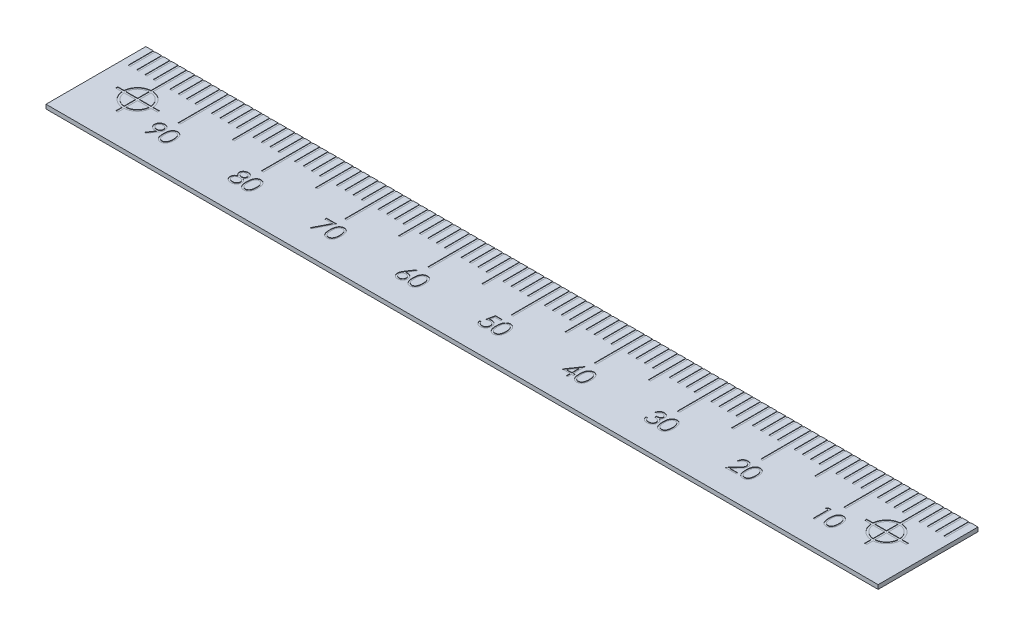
from build123d import *

# Parameters (mm, degrees)
SKETCH1_W           = 100
SKETCH1_H           = 12
BOSS_EXTRUDE1_DEPTH = 0.5
SKETCH2_W           = 0.25
SKETCH2_H           = 3
CUT_EXTRUDE2_DEPTH  = 0.05
LPATTERN2_COUNT     = 99
LPATTERN2_PITCH     = 1
SKETCH3_W           = 0.25
SKETCH3_H           = 3
CUT_EXTRUDE3_DEPTH  = 0.05
LPATTERN3_COUNT     = 9
LPATTERN3_PITCH     = 10
SKETCH4_W           = 0.25
SKETCH4_H           = 1.5
CUT_EXTRUDE4_DEPTH  = 0.05
LPATTERN4_COUNT     = 9
LPATTERN4_PITCH     = 10
LPATTERN4_COL_COUNT = 2
LPATTERN4_COL_PITCH = 10
CUT_EXTRUDE6_DEPTH  = 0.05
LPATTERN5_COUNT     = 2
LPATTERN5_PITCH     = 90
CUT_EXTRUDE12_DEPTH = 0.05
CUT_EXTRUDE13_DEPTH = 0.05


with BuildPart() as part:
    # Sketch1 → Boss-Extrude1 (new body)
    with BuildSketch(Plane(origin=(0, 0, 0), x_dir=(1, 0, 0), z_dir=(0, 1, 0))):
        Rectangle(SKETCH1_W, SKETCH1_H)
    extrude(amount=-BOSS_EXTRUDE1_DEPTH)

    # Sketch2 → Cut-Extrude2 (cut)
    with BuildSketch(Plane(origin=(0, 0, 0), x_dir=(1, 0, 0), z_dir=(0, 1, 0))):
        with Locations((-49, 4.5)):
            Rectangle(SKETCH2_W, SKETCH2_H)
    cut_extrude2 = extrude(amount=-CUT_EXTRUDE2_DEPTH, mode=Mode.SUBTRACT)

    # LPattern2: Cut-Extrude2 ×99
    with Locations(*[(i * LPATTERN2_PITCH, 0, 0) for i in range(1, LPATTERN2_COUNT)]):
        add(cut_extrude2, mode=Mode.SUBTRACT)

    # Sketch3 → Cut-Extrude3 (cut)
    with BuildSketch(Plane(origin=(0, 0, 0), x_dir=(1, 0, 0), z_dir=(0, 1, 0))):
        with Locations((-40, 1.5)):
            Rectangle(SKETCH3_W, SKETCH3_H)
    cut_extrude3 = extrude(amount=-CUT_EXTRUDE3_DEPTH, mode=Mode.SUBTRACT)

    # LPattern3: Cut-Extrude3 ×9
    with Locations(*[(i * LPATTERN3_PITCH, 0, 0) for i in range(1, LPATTERN3_COUNT)]):
        add(cut_extrude3, mode=Mode.SUBTRACT)

    # Sketch4 → Cut-Extrude4 (cut)
    with BuildSketch(Plane(origin=(0, 0, 0), x_dir=(1, 0, 0), z_dir=(0, 1, 0))):
        with Locations((-35, 2.25)):
            Rectangle(SKETCH4_W, SKETCH4_H)
    cut_extrude4 = extrude(amount=-CUT_EXTRUDE4_DEPTH, mode=Mode.SUBTRACT)

    # LPattern4: Cut-Extrude4 ×9
    with Locations(*[(i * LPATTERN4_PITCH, 0, 0) for i in range(1, LPATTERN4_COUNT)]):
        add(cut_extrude4, mode=Mode.SUBTRACT)

    # LPattern4 col: Cut-Extrude4 ×2
    with Locations(*[(-i * LPATTERN4_COL_PITCH, 0, 0) for i in range(1, LPATTERN4_COL_COUNT)]):
        add(cut_extrude4, mode=Mode.SUBTRACT)

    # Sketch5 → Cut-Extrude6 (cut)
    with BuildSketch(Plane(origin=(0, 0, 0), x_dir=(1, 0, 0), z_dir=(0, 1, 0))):
        with BuildLine():
            Line((-45.12, 2.5), (-44.87, 2.5))
            Line((-44.87, 2.5), (-44.87, 1.745530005))
            ThreePointArc((-44.87, 1.745530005), (-43.757563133, 1.237436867), (-43.249469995, 0.125))
            Line((-43.249469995, 0.125), (-42.495, 0.125))
            Line((-42.495, 0.125), (-42.495, -0.125))
            Line((-42.495, -0.125), (-43.249469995, -0.125))
            ThreePointArc((-43.249469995, -0.125), (-43.757563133, -1.237436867), (-44.87, -1.745530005))
            Line((-44.87, -1.745530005), (-44.87, -2.5))
            Line((-44.87, -2.5), (-45.12, -2.5))
            Line((-45.12, -2.5), (-45.12, -1.745530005))
            ThreePointArc((-45.12, -1.745530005), (-46.232436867, -1.237436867), (-46.740530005, -0.125))
            Line((-46.740530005, -0.125), (-47.495, -0.125))
            Line((-47.495, -0.125), (-47.495, 0.125))
            Line((-47.495, 0.125), (-46.740530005, 0.125))
            ThreePointArc((-46.740530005, 0.125), (-46.232436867, 1.237436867), (-45.12, 1.745530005))
            Line((-45.12, 1.745530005), (-45.12, 2.5))
        make_face()
        with BuildLine():
            Line((-45.12, 1.494782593), (-45.12, 0.125))
            Line((-45.12, 0.125), (-46.489782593, 0.125))
            ThreePointArc((-46.489782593, 0.125), (-46.055660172, 1.060660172), (-45.12, 1.494782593))
        make_face(mode=Mode.SUBTRACT)
        with BuildLine():
            Line((-44.87, 1.494782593), (-44.87, 0.125))
            Line((-44.87, 0.125), (-43.500217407, 0.125))
            ThreePointArc((-43.500217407, 0.125), (-43.934339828, 1.060660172), (-44.87, 1.494782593))
        make_face(mode=Mode.SUBTRACT)
        with BuildLine():
            Line((-46.489782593, -0.125), (-45.12, -0.125))
            Line((-45.12, -0.125), (-45.12, -1.494782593))
            ThreePointArc((-45.12, -1.494782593), (-46.055660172, -1.060660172), (-46.489782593, -0.125))
        make_face(mode=Mode.SUBTRACT)
        with BuildLine():
            Line((-44.87, -0.125), (-44.87, -1.494782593))
            ThreePointArc((-44.87, -1.494782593), (-43.934339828, -1.060660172), (-43.500217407, -0.125))
            Line((-43.500217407, -0.125), (-44.87, -0.125))
        make_face(mode=Mode.SUBTRACT)
    cut_extrude6 = extrude(amount=-CUT_EXTRUDE6_DEPTH, mode=Mode.SUBTRACT)

    # LPattern5: Cut-Extrude6 ×2
    with Locations(*[(i * LPATTERN5_PITCH, 0, 0) for i in range(1, LPATTERN5_COUNT)]):
        add(cut_extrude6, mode=Mode.SUBTRACT)

    # Sketch15 → Cut-Extrude12 (cut)
    # profile 1 of 8: a face of its own
    with BuildSketch(Plane(origin=(0, 0, 0), x_dir=(1, 0, 0), z_dir=(0, 1, 0))):
        Polygon((9.668669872, -0.948717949), (9.705128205, -0.948717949), (9.705128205, -2.333333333), (9.935897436, -2.333333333), (9.935897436, -2.538461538), (9.705128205, -2.538461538), (9.705128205, -3), (9.525641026, -3), (9.525641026, -2.538461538), (8.576923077, -2.538461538), align=None)
        Polygon((9.525641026, -2.333333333), (9.525641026, -1.46474359), (8.929487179, -2.333333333), align=None, mode=Mode.SUBTRACT)
    # profile 2 of 8: a face of its own
    with BuildSketch(Plane(origin=(0, 0, 0), x_dir=(1, 0, 0), z_dir=(0, 1, 0))):
        with BuildLine():
            add(Edge.make_bspline(
                [(10.115384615, -2.000801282), (10.115572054, -1.968745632), (10.115936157, -1.906477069), (10.119986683, -1.815742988), (10.12671545, -1.730622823), (10.135936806, -1.6511125), (10.147158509, -1.577191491), (10.162138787, -1.509057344), (10.179174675, -1.446394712), (10.198918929, -1.388999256), (10.221197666, -1.336097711), (10.245445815, -1.286711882), (10.272625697, -1.240916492), (10.301183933, -1.197980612), (10.332276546, -1.158607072), (10.365018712, -1.122239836), (10.400688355, -1.089719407), (10.438072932, -1.060092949), (10.477510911, -1.034121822), (10.517878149, -1.011245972), (10.559452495, -0.99170319), (10.602347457, -0.976337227), (10.64617749, -0.963645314), (10.691095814, -0.954965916), (10.737176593, -0.949504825), (10.76828027, -0.948982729), (10.784054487, -0.948717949)],
                knots=[0, 0, 0, 0, 1.646270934, 3.197905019, 4.663502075, 6.030701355, 7.308322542, 8.50163776, 9.611534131, 10.641858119, 11.616356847, 12.558055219, 13.465016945, 14.349605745, 15.204443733, 16.039544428, 16.859896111, 17.680448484, 18.487036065, 19.28249412, 20.06191084, 20.843045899, 21.620316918, 22.403196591, 23.190181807, 24, 24, 24, 24], degree=3))
            add(Edge.make_bspline(
                [(10.784054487, -0.948717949), (10.799960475, -0.9489967), (10.83159248, -0.949551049), (10.878358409, -0.954879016), (10.924043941, -0.963719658), (10.968454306, -0.976245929), (11.011954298, -0.991786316), (11.054203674, -1.011264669), (11.095464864, -1.033938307), (11.135082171, -1.060580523), (11.173490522, -1.090284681), (11.209746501, -1.123863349), (11.243853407, -1.160977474), (11.276239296, -1.201229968), (11.305985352, -1.245392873), (11.334313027, -1.292698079), (11.359668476, -1.343972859), (11.384088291, -1.398361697), (11.405166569, -1.457369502), (11.424175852, -1.520663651), (11.439535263, -1.588991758), (11.452329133, -1.661995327), (11.462240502, -1.73994246), (11.469459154, -1.822666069), (11.473272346, -1.910220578), (11.473990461, -1.970082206), (11.474358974, -2.000801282)],
                knots=[0, 0, 0, 0, 0.810914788, 1.612654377, 2.396697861, 3.181598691, 3.963628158, 4.749916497, 5.551656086, 6.361998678, 7.18212741, 8.025565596, 8.878627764, 9.750805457, 10.657531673, 11.591944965, 12.560506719, 13.57287815, 14.630710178, 15.753379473, 16.941251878, 18.199788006, 19.531962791, 20.947069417, 22.433333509, 24, 24, 24, 24], degree=3))
            add(Edge.make_bspline(
                [(11.474358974, -2.000801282), (11.47398664, -2.031386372), (11.473261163, -2.090980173), (11.469501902, -2.178140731), (11.46209697, -2.260425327), (11.452834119, -2.338031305), (11.440004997, -2.410635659), (11.424230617, -2.47848963), (11.406716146, -2.541886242), (11.385096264, -2.600306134), (11.361433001, -2.654564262), (11.335687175, -2.705231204), (11.308104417, -2.752754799), (11.278053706, -2.796754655), (11.246023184, -2.837542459), (11.211327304, -2.874398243), (11.174944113, -2.908210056), (11.136422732, -2.9382967), (11.09618756, -2.964630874), (11.055068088, -2.988181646), (11.012334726, -3.007171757), (10.968955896, -3.023477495), (10.924311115, -3.035934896), (10.878456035, -3.044548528), (10.8316239, -3.050589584), (10.799965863, -3.05105043), (10.784054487, -3.051282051)],
                knots=[0, 0, 0, 0, 1.561518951, 3.042555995, 4.452378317, 5.7783523, 7.031515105, 8.214008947, 9.334062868, 10.386615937, 11.391082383, 12.354592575, 13.286541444, 14.194233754, 15.072674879, 15.931287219, 16.775624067, 17.606195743, 18.42308326, 19.229000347, 20.022332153, 20.807536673, 21.593273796, 22.3848459, 23.188221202, 24, 24, 24, 24], degree=3))
            add(Edge.make_bspline(
                [(10.784054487, -3.051282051), (10.768280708, -3.051015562), (10.737177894, -3.050490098), (10.691090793, -3.04505368), (10.646357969, -3.036313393), (10.602758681, -3.024075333), (10.560069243, -3.009095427), (10.518871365, -2.989579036), (10.478706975, -2.967102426), (10.439683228, -2.941505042), (10.402533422, -2.912178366), (10.367048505, -2.879741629), (10.334119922, -2.843385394), (10.303471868, -2.803683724), (10.274343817, -2.761001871), (10.24754989, -2.714757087), (10.222766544, -2.665132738), (10.200113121, -2.611808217), (10.180028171, -2.554005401), (10.162286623, -2.491063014), (10.148278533, -2.422425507), (10.136288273, -2.348644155), (10.126617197, -2.269401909), (10.120014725, -2.18465575), (10.115933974, -2.094458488), (10.115571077, -2.032590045), (10.115384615, -2.000801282)],
                knots=[0, 0, 0, 0, 0.810891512, 1.598919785, 2.382837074, 3.152667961, 3.926044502, 4.706494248, 5.493654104, 6.291793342, 7.103789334, 7.925228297, 8.761435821, 9.622817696, 10.50288917, 11.416980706, 12.369136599, 13.353924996, 14.394355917, 15.514179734, 16.714354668, 17.994756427, 19.357759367, 20.818452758, 22.365282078, 24, 24, 24, 24], degree=3))
        make_face()
        with BuildLine():
            add(Edge.make_bspline(
                [(10.294871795, -2), (10.29494005, -2.026713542), (10.295072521, -2.078559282), (10.298533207, -2.153898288), (10.303247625, -2.224167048), (10.309328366, -2.289454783), (10.318358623, -2.349540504), (10.328476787, -2.404837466), (10.340789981, -2.45505303), (10.355358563, -2.500531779), (10.371952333, -2.542045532), (10.390069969, -2.580674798), (10.409533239, -2.616875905), (10.431315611, -2.650323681), (10.455038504, -2.681127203), (10.480166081, -2.709831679), (10.507636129, -2.735429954), (10.545638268, -2.766131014), (10.595807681, -2.797856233), (10.65901937, -2.82548257), (10.723972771, -2.842843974), (10.768059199, -2.845051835), (10.790064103, -2.846153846)],
                knots=[0, 0, 0, 0, 1.459021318, 2.831673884, 4.118529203, 5.306027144, 6.411944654, 7.436330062, 8.375795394, 9.233974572, 10.042671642, 10.816086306, 11.563610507, 12.285937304, 12.993564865, 13.685989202, 14.367179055, 15.041617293, 16.353048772, 17.594441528, 18.799311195, 20, 20, 20, 20], degree=3))
            add(Edge.make_bspline(
                [(10.790064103, -2.846153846), (10.812211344, -2.845240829), (10.8564601, -2.843416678), (10.921107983, -2.8258174), (10.983868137, -2.799263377), (11.033052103, -2.767864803), (11.070470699, -2.7379629), (11.097280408, -2.712468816), (11.121887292, -2.683922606), (11.145225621, -2.653123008), (11.166630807, -2.619481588), (11.186095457, -2.583160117), (11.20385737, -2.544057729), (11.213976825, -2.516760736), (11.219150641, -2.502804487)],
                knots=[0, 0, 0, 0, 1.353760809, 2.704726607, 4.075137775, 5.516104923, 6.260822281, 7.007110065, 7.778089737, 8.566572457, 9.372053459, 10.217411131, 11.088608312, 12, 12, 12, 12], degree=3))
            add(Edge.make_bspline(
                [(11.219150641, -2.502804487), (11.225180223, -2.484958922), (11.237422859, -2.448724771), (11.253201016, -2.39251697), (11.265626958, -2.333543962), (11.276806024, -2.272158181), (11.284436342, -2.207906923), (11.29057795, -2.140988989), (11.294195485, -2.071353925), (11.294643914, -2.024042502), (11.294871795, -2)],
                knots=[0, 0, 0, 0, 0.884706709, 1.796334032, 2.740027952, 3.714592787, 4.726048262, 5.777819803, 6.87074269, 8, 8, 8, 8], degree=3))
            add(Edge.make_bspline(
                [(11.294871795, -2), (11.294557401, -1.975961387), (11.293942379, -1.928936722), (11.291591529, -1.86006919), (11.285520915, -1.794659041), (11.278778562, -1.732424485), (11.268837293, -1.673710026), (11.258118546, -1.618024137), (11.243717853, -1.566056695), (11.228335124, -1.516994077), (11.210729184, -1.471393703), (11.191348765, -1.429042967), (11.170650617, -1.38973741), (11.148169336, -1.353584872), (11.124171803, -1.320423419), (11.098024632, -1.290917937), (11.070764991, -1.264153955), (11.032583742, -1.233603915), (10.982598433, -1.202454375), (10.92040092, -1.173788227), (10.855674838, -1.157326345), (10.811918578, -1.155005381), (10.790064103, -1.153846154)],
                knots=[0, 0, 0, 0, 1.31362396, 2.569729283, 3.763502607, 4.902122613, 5.988968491, 7.01645872, 7.998833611, 8.933434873, 9.825090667, 10.667526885, 11.477055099, 12.250526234, 12.991942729, 13.710640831, 14.402115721, 15.076753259, 16.378508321, 17.609869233, 18.806226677, 20, 20, 20, 20], degree=3))
            add(Edge.make_bspline(
                [(10.790064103, -1.153846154), (10.767943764, -1.155006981), (10.72366279, -1.157330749), (10.658263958, -1.173726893), (10.595575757, -1.202305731), (10.545722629, -1.233707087), (10.507514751, -1.263614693), (10.480610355, -1.28954981), (10.455383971, -1.317919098), (10.432145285, -1.349005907), (10.41037998, -1.382414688), (10.39039083, -1.418408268), (10.372380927, -1.457169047), (10.355761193, -1.498664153), (10.341148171, -1.544138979), (10.329094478, -1.594292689), (10.317959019, -1.64941377), (10.310076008, -1.709824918), (10.303068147, -1.775129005), (10.29856452, -1.845573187), (10.295060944, -1.921038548), (10.294936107, -1.973152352), (10.294871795, -2)],
                knots=[0, 0, 0, 0, 1.207732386, 2.417664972, 3.655092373, 4.956220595, 5.625982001, 6.301752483, 6.994047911, 7.697131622, 8.419323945, 9.170223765, 9.943494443, 10.752040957, 11.610060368, 12.549350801, 13.567764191, 14.679664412, 15.874934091, 17.154273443, 18.533957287, 20, 20, 20, 20], degree=3))
        make_face(mode=Mode.SUBTRACT)
    # profile 3 of 8: a face of its own
    with BuildSketch(Plane(origin=(0, 0, 0), x_dir=(1, 0, 0), z_dir=(0, 1, 0))):
        with BuildLine():
            Line((18.833333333, -1.461538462), (18.653846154, -1.461538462))
            add(Edge.make_bspline(
                [(18.653846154, -1.461538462), (18.658708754, -1.441405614), (18.66821474, -1.402047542), (18.688041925, -1.345814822), (18.7096415, -1.292601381), (18.735578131, -1.243403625), (18.763868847, -1.197232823), (18.796281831, -1.155136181), (18.831321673, -1.116043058), (18.870078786, -1.081349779), (18.910723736, -1.049933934), (18.953829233, -1.023148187), (18.998528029, -1.000105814), (19.04512982, -0.981122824), (19.093773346, -0.966822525), (19.144018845, -0.956447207), (19.195997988, -0.949709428), (19.231282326, -0.949051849), (19.249198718, -0.948717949)],
                knots=[0, 0, 0, 0, 1.162005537, 2.271625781, 3.343758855, 4.383309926, 5.390229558, 6.379919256, 7.361854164, 8.333198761, 9.295911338, 10.242430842, 11.177959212, 12.116337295, 13.062827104, 14.020064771, 14.994644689, 16, 16, 16, 16], degree=3))
            add(Edge.make_bspline(
                [(19.249198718, -0.948717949), (19.275303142, -0.94950608), (19.326942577, -0.951065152), (19.402807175, -0.965301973), (19.475965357, -0.98783062), (19.545616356, -1.018958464), (19.610312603, -1.057351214), (19.667876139, -1.10304535), (19.717526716, -1.155159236), (19.759180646, -1.212720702), (19.791794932, -1.274238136), (19.815844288, -1.337552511), (19.830485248, -1.402513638), (19.832382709, -1.44637494), (19.833333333, -1.468349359)],
                knots=[0, 0, 0, 0, 1.083050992, 2.142477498, 3.193116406, 4.255571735, 5.30263384, 6.308962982, 7.297363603, 8.282367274, 9.249857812, 10.179914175, 11.08814088, 12, 12, 12, 12], degree=3))
            add(Edge.make_bspline(
                [(19.833333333, -1.468349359), (19.832668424, -1.489496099), (19.8313673, -1.530876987), (19.820319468, -1.591289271), (19.801727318, -1.648227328), (19.775973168, -1.70193085), (19.742635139, -1.75205933), (19.702250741, -1.798725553), (19.654534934, -1.8421365), (19.618375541, -1.867004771), (19.599759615, -1.879807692)],
                knots=[0, 0, 0, 0, 1.024540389, 2.004866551, 2.965041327, 3.920577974, 4.882998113, 5.874504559, 6.905732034, 8, 8, 8, 8], degree=3))
            add(Edge.make_bspline(
                [(19.599759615, -1.879807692), (19.621034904, -1.890080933), (19.663187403, -1.910435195), (19.720644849, -1.95035277), (19.772803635, -1.996442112), (19.801891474, -2.032409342), (19.81650641, -2.050480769)],
                knots=[0, 0, 0, 0, 1.015518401, 2.012035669, 3.001164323, 4, 4, 4, 4], degree=3))
            add(Edge.make_bspline(
                [(19.81650641, -2.050480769), (19.826130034, -2.063656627), (19.845219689, -2.08979258), (19.868782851, -2.131813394), (19.890159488, -2.17429996), (19.906816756, -2.218391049), (19.919716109, -2.263575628), (19.928936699, -2.309931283), (19.934664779, -2.357495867), (19.935485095, -2.389674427), (19.935897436, -2.405849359)],
                knots=[0, 0, 0, 0, 1.025084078, 2.033381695, 3.024893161, 4.013698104, 4.991890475, 5.976764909, 6.982997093, 8, 8, 8, 8], degree=3))
            add(Edge.make_bspline(
                [(19.935897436, -2.405849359), (19.934872, -2.433854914), (19.932825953, -2.489734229), (19.91453791, -2.572291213), (19.886187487, -2.6529915), (19.845926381, -2.730177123), (19.796859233, -2.802394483), (19.738483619, -2.867009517), (19.671462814, -2.922551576), (19.596716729, -2.968957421), (19.515735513, -3.006053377), (19.429120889, -3.031800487), (19.338120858, -3.048569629), (19.275716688, -3.05036784), (19.243990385, -3.051282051)],
                knots=[0, 0, 0, 0, 0.955779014, 1.907060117, 2.875433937, 3.871313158, 4.872415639, 5.851225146, 6.836215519, 7.83643374, 8.849228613, 9.86973379, 10.916971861, 12, 12, 12, 12], degree=3))
            add(Edge.make_bspline(
                [(19.243990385, -3.051282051), (19.222607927, -3.050785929), (19.180534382, -3.049809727), (19.118680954, -3.043136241), (19.059639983, -3.030947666), (19.003331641, -3.014545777), (18.949705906, -2.993750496), (18.898926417, -2.967854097), (18.850680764, -2.937390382), (18.805424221, -2.90199976), (18.763162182, -2.862410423), (18.725017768, -2.81791956), (18.690355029, -2.769349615), (18.660102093, -2.71613644), (18.632880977, -2.658967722), (18.610491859, -2.597111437), (18.59078582, -2.531120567), (18.58162384, -2.485133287), (18.576923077, -2.461538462)],
                knots=[0, 0, 0, 0, 1.048658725, 2.063410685, 3.046034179, 4.001477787, 4.936774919, 5.862367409, 6.792675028, 7.730719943, 8.675894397, 9.627829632, 10.600096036, 11.597688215, 12.626045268, 13.701542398, 14.82072376, 16, 16, 16, 16], degree=3))
            Line((18.576923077, -2.461538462), (18.756410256, -2.461538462))
            add(Edge.make_bspline(
                [(18.756410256, -2.461538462), (18.761086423, -2.476937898), (18.770181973, -2.506891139), (18.785664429, -2.549999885), (18.803303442, -2.589518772), (18.822226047, -2.625737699), (18.842099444, -2.659013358), (18.864336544, -2.688465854), (18.887290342, -2.715388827), (18.904592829, -2.730557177), (18.913060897, -2.737980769)],
                knots=[0, 0, 0, 0, 1.198163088, 2.33053128, 3.407730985, 4.417276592, 5.372219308, 6.28897303, 7.162600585, 8, 8, 8, 8], degree=3))
            add(Edge.make_bspline(
                [(18.913060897, -2.737980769), (18.924258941, -2.746614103), (18.946620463, -2.763854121), (18.983059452, -2.785855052), (19.021382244, -2.804918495), (19.062419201, -2.819480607), (19.105284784, -2.831810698), (19.15067185, -2.839879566), (19.198179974, -2.845415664), (19.230618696, -2.845904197), (19.247195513, -2.846153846)],
                knots=[0, 0, 0, 0, 0.946170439, 1.889420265, 2.845303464, 3.807233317, 4.801018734, 5.828864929, 6.890507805, 8, 8, 8, 8], degree=3))
            add(Edge.make_bspline(
                [(19.247195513, -2.846153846), (19.2659118, -2.8458019), (19.302509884, -2.845113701), (19.355912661, -2.838784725), (19.406716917, -2.829567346), (19.454358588, -2.815331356), (19.499461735, -2.797742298), (19.541394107, -2.775657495), (19.580706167, -2.749746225), (19.616894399, -2.720295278), (19.649434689, -2.688054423), (19.678085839, -2.654332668), (19.702442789, -2.619272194), (19.722090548, -2.582678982), (19.737605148, -2.544704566), (19.748166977, -2.505242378), (19.7555107, -2.464615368), (19.756108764, -2.436998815), (19.756410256, -2.423076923)],
                knots=[0, 0, 0, 0, 1.217147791, 2.380027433, 3.494444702, 4.572153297, 5.609568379, 6.639424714, 7.649109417, 8.668170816, 9.669597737, 10.625200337, 11.543417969, 12.441394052, 13.322311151, 14.205496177, 15.095365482, 16, 16, 16, 16], degree=3))
            add(Edge.make_bspline(
                [(19.756410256, -2.423076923), (19.755535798, -2.404441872), (19.753791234, -2.367264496), (19.740472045, -2.312568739), (19.718564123, -2.259869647), (19.687894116, -2.210066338), (19.650559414, -2.16390868), (19.606922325, -2.122724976), (19.55662048, -2.088742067), (19.510323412, -2.065262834), (19.469314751, -2.049241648), (19.434220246, -2.03857024), (19.394930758, -2.029533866), (19.351921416, -2.021126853), (19.304868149, -2.013971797), (19.253822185, -2.008005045), (19.198773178, -2.003230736), (19.16066394, -2.001098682), (19.141025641, -2)],
                knots=[0, 0, 0, 0, 1.07054697, 2.135767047, 3.216561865, 4.33974944, 5.486079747, 6.621378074, 7.775625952, 8.963672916, 9.598146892, 10.304877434, 11.070270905, 11.915000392, 12.823868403, 13.805723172, 14.86925407, 16, 16, 16, 16], degree=3))
            Line((19.141025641, -2), (19.141025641, -1.794871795))
            add(Edge.make_bspline(
                [(19.141025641, -1.794871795), (19.165769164, -1.794451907), (19.214235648, -1.79362945), (19.285032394, -1.783682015), (19.352731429, -1.769921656), (19.415832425, -1.748844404), (19.473345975, -1.724364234), (19.523242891, -1.695877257), (19.564824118, -1.664211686), (19.597887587, -1.628878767), (19.622761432, -1.590984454), (19.640948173, -1.551489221), (19.651691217, -1.5100469), (19.653125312, -1.481764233), (19.653846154, -1.467548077)],
                knots=[0, 0, 0, 0, 1.321986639, 2.589447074, 3.816329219, 5.01088745, 6.139805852, 7.153945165, 8.075214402, 8.924034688, 9.728124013, 10.488707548, 11.240355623, 12, 12, 12, 12], degree=3))
            add(Edge.make_bspline(
                [(19.653846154, -1.467548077), (19.653609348, -1.457103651), (19.653138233, -1.436324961), (19.647196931, -1.405967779), (19.638268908, -1.376538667), (19.625994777, -1.348162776), (19.609566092, -1.321036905), (19.589905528, -1.294929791), (19.566495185, -1.269990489), (19.539669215, -1.246744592), (19.51086247, -1.224590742), (19.47929117, -1.20578295), (19.445907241, -1.189700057), (19.410673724, -1.176437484), (19.373476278, -1.166460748), (19.334489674, -1.15929741), (19.293639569, -1.154818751), (19.265770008, -1.154173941), (19.251602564, -1.153846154)],
                knots=[0, 0, 0, 0, 0.884392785, 1.759457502, 2.611959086, 3.489218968, 4.37281399, 5.2945488, 6.255912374, 7.266815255, 8.301784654, 9.332968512, 10.37626691, 11.440494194, 12.520033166, 13.637162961, 14.798855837, 16, 16, 16, 16], degree=3))
            add(Edge.make_bspline(
                [(19.251602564, -1.153846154), (19.228830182, -1.154641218), (19.184350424, -1.156194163), (19.120227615, -1.169795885), (19.060616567, -1.191497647), (19.015051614, -1.217402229), (18.981404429, -1.242973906), (18.957360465, -1.265306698), (18.933748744, -1.290125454), (18.912122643, -1.318958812), (18.890251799, -1.34985412), (18.870340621, -1.384381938), (18.850992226, -1.421641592), (18.839333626, -1.447981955), (18.833333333, -1.461538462)],
                knots=[0, 0, 0, 0, 1.472543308, 2.876219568, 4.221790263, 5.565193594, 6.249813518, 6.953379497, 7.687249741, 8.463570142, 9.283606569, 10.136032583, 11.040678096, 12, 12, 12, 12], degree=3))
        make_face()
    # profile 4 of 8: a face of its own
    with BuildSketch(Plane(origin=(0, 0, 0), x_dir=(1, 0, 0), z_dir=(0, 1, 0))):
        with BuildLine():
            add(Edge.make_bspline(
                [(20.115384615, -2.000801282), (20.115572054, -1.968745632), (20.115936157, -1.906477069), (20.119986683, -1.815742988), (20.12671545, -1.730622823), (20.135936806, -1.6511125), (20.147158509, -1.577191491), (20.162138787, -1.509057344), (20.179174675, -1.446394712), (20.198918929, -1.388999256), (20.221197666, -1.336097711), (20.245445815, -1.286711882), (20.272625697, -1.240916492), (20.301183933, -1.197980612), (20.332276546, -1.158607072), (20.365018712, -1.122239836), (20.400688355, -1.089719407), (20.438072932, -1.060092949), (20.477510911, -1.034121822), (20.517878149, -1.011245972), (20.559452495, -0.99170319), (20.602347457, -0.976337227), (20.64617749, -0.963645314), (20.691095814, -0.954965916), (20.737176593, -0.949504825), (20.76828027, -0.948982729), (20.784054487, -0.948717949)],
                knots=[0, 0, 0, 0, 1.646270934, 3.197905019, 4.663502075, 6.030701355, 7.308322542, 8.50163776, 9.611534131, 10.641858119, 11.616356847, 12.558055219, 13.465016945, 14.349605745, 15.204443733, 16.039544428, 16.859896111, 17.680448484, 18.487036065, 19.28249412, 20.06191084, 20.843045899, 21.620316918, 22.403196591, 23.190181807, 24, 24, 24, 24], degree=3))
            add(Edge.make_bspline(
                [(20.784054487, -0.948717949), (20.799960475, -0.9489967), (20.83159248, -0.949551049), (20.878358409, -0.954879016), (20.924043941, -0.963719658), (20.968454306, -0.976245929), (21.011954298, -0.991786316), (21.054203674, -1.011264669), (21.095464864, -1.033938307), (21.135082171, -1.060580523), (21.173490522, -1.090284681), (21.209746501, -1.123863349), (21.243853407, -1.160977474), (21.276239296, -1.201229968), (21.305985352, -1.245392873), (21.334313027, -1.292698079), (21.359668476, -1.343972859), (21.384088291, -1.398361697), (21.405166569, -1.457369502), (21.424175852, -1.520663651), (21.439535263, -1.588991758), (21.452329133, -1.661995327), (21.462240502, -1.73994246), (21.469459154, -1.822666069), (21.473272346, -1.910220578), (21.473990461, -1.970082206), (21.474358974, -2.000801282)],
                knots=[0, 0, 0, 0, 0.810914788, 1.612654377, 2.396697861, 3.181598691, 3.963628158, 4.749916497, 5.551656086, 6.361998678, 7.18212741, 8.025565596, 8.878627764, 9.750805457, 10.657531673, 11.591944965, 12.560506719, 13.57287815, 14.630710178, 15.753379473, 16.941251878, 18.199788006, 19.531962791, 20.947069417, 22.433333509, 24, 24, 24, 24], degree=3))
            add(Edge.make_bspline(
                [(21.474358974, -2.000801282), (21.47398664, -2.031386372), (21.473261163, -2.090980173), (21.469501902, -2.178140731), (21.46209697, -2.260425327), (21.452834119, -2.338031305), (21.440004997, -2.410635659), (21.424230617, -2.47848963), (21.406716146, -2.541886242), (21.385096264, -2.600306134), (21.361433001, -2.654564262), (21.335687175, -2.705231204), (21.308104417, -2.752754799), (21.278053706, -2.796754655), (21.246023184, -2.837542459), (21.211327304, -2.874398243), (21.174944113, -2.908210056), (21.136422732, -2.9382967), (21.09618756, -2.964630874), (21.055068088, -2.988181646), (21.012334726, -3.007171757), (20.968955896, -3.023477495), (20.924311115, -3.035934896), (20.878456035, -3.044548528), (20.8316239, -3.050589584), (20.799965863, -3.05105043), (20.784054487, -3.051282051)],
                knots=[0, 0, 0, 0, 1.561518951, 3.042555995, 4.452378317, 5.7783523, 7.031515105, 8.214008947, 9.334062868, 10.386615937, 11.391082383, 12.354592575, 13.286541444, 14.194233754, 15.072674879, 15.931287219, 16.775624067, 17.606195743, 18.42308326, 19.229000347, 20.022332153, 20.807536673, 21.593273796, 22.3848459, 23.188221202, 24, 24, 24, 24], degree=3))
            add(Edge.make_bspline(
                [(20.784054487, -3.051282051), (20.768280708, -3.051015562), (20.737177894, -3.050490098), (20.691090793, -3.04505368), (20.646357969, -3.036313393), (20.602758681, -3.024075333), (20.560069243, -3.009095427), (20.518871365, -2.989579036), (20.478706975, -2.967102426), (20.439683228, -2.941505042), (20.402533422, -2.912178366), (20.367048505, -2.879741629), (20.334119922, -2.843385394), (20.303471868, -2.803683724), (20.274343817, -2.761001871), (20.24754989, -2.714757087), (20.222766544, -2.665132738), (20.200113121, -2.611808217), (20.180028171, -2.554005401), (20.162286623, -2.491063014), (20.148278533, -2.422425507), (20.136288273, -2.348644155), (20.126617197, -2.269401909), (20.120014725, -2.18465575), (20.115933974, -2.094458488), (20.115571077, -2.032590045), (20.115384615, -2.000801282)],
                knots=[0, 0, 0, 0, 0.810891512, 1.598919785, 2.382837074, 3.152667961, 3.926044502, 4.706494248, 5.493654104, 6.291793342, 7.103789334, 7.925228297, 8.761435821, 9.622817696, 10.50288917, 11.416980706, 12.369136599, 13.353924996, 14.394355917, 15.514179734, 16.714354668, 17.994756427, 19.357759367, 20.818452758, 22.365282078, 24, 24, 24, 24], degree=3))
        make_face()
        with BuildLine():
            add(Edge.make_bspline(
                [(20.294871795, -2), (20.29494005, -2.026713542), (20.295072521, -2.078559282), (20.298533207, -2.153898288), (20.303247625, -2.224167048), (20.309328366, -2.289454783), (20.318358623, -2.349540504), (20.328476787, -2.404837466), (20.340789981, -2.45505303), (20.355358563, -2.500531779), (20.371952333, -2.542045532), (20.390069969, -2.580674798), (20.409533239, -2.616875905), (20.431315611, -2.650323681), (20.455038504, -2.681127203), (20.480166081, -2.709831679), (20.507636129, -2.735429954), (20.545638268, -2.766131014), (20.595807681, -2.797856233), (20.65901937, -2.82548257), (20.723972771, -2.842843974), (20.768059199, -2.845051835), (20.790064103, -2.846153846)],
                knots=[0, 0, 0, 0, 1.459021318, 2.831673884, 4.118529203, 5.306027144, 6.411944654, 7.436330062, 8.375795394, 9.233974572, 10.042671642, 10.816086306, 11.563610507, 12.285937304, 12.993564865, 13.685989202, 14.367179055, 15.041617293, 16.353048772, 17.594441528, 18.799311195, 20, 20, 20, 20], degree=3))
            add(Edge.make_bspline(
                [(20.790064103, -2.846153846), (20.812211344, -2.845240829), (20.8564601, -2.843416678), (20.921107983, -2.8258174), (20.983868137, -2.799263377), (21.033052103, -2.767864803), (21.070470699, -2.7379629), (21.097280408, -2.712468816), (21.121887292, -2.683922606), (21.145225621, -2.653123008), (21.166630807, -2.619481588), (21.186095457, -2.583160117), (21.20385737, -2.544057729), (21.213976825, -2.516760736), (21.219150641, -2.502804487)],
                knots=[0, 0, 0, 0, 1.353760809, 2.704726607, 4.075137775, 5.516104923, 6.260822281, 7.007110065, 7.778089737, 8.566572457, 9.372053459, 10.217411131, 11.088608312, 12, 12, 12, 12], degree=3))
            add(Edge.make_bspline(
                [(21.219150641, -2.502804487), (21.225180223, -2.484958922), (21.237422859, -2.448724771), (21.253201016, -2.39251697), (21.265626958, -2.333543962), (21.276806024, -2.272158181), (21.284436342, -2.207906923), (21.29057795, -2.140988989), (21.294195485, -2.071353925), (21.294643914, -2.024042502), (21.294871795, -2)],
                knots=[0, 0, 0, 0, 0.884706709, 1.796334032, 2.740027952, 3.714592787, 4.726048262, 5.777819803, 6.87074269, 8, 8, 8, 8], degree=3))
            add(Edge.make_bspline(
                [(21.294871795, -2), (21.294557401, -1.975961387), (21.293942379, -1.928936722), (21.291591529, -1.86006919), (21.285520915, -1.794659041), (21.278778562, -1.732424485), (21.268837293, -1.673710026), (21.258118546, -1.618024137), (21.243717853, -1.566056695), (21.228335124, -1.516994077), (21.210729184, -1.471393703), (21.191348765, -1.429042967), (21.170650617, -1.38973741), (21.148169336, -1.353584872), (21.124171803, -1.320423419), (21.098024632, -1.290917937), (21.070764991, -1.264153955), (21.032583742, -1.233603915), (20.982598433, -1.202454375), (20.92040092, -1.173788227), (20.855674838, -1.157326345), (20.811918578, -1.155005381), (20.790064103, -1.153846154)],
                knots=[0, 0, 0, 0, 1.31362396, 2.569729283, 3.763502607, 4.902122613, 5.988968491, 7.01645872, 7.998833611, 8.933434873, 9.825090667, 10.667526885, 11.477055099, 12.250526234, 12.991942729, 13.710640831, 14.402115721, 15.076753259, 16.378508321, 17.609869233, 18.806226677, 20, 20, 20, 20], degree=3))
            add(Edge.make_bspline(
                [(20.790064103, -1.153846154), (20.767943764, -1.155006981), (20.72366279, -1.157330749), (20.658263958, -1.173726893), (20.595575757, -1.202305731), (20.545722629, -1.233707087), (20.507514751, -1.263614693), (20.480610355, -1.28954981), (20.455383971, -1.317919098), (20.432145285, -1.349005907), (20.41037998, -1.382414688), (20.39039083, -1.418408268), (20.372380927, -1.457169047), (20.355761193, -1.498664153), (20.341148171, -1.544138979), (20.329094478, -1.594292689), (20.317959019, -1.64941377), (20.310076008, -1.709824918), (20.303068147, -1.775129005), (20.29856452, -1.845573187), (20.295060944, -1.921038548), (20.294936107, -1.973152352), (20.294871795, -2)],
                knots=[0, 0, 0, 0, 1.207732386, 2.417664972, 3.655092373, 4.956220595, 5.625982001, 6.301752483, 6.994047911, 7.697131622, 8.419323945, 9.170223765, 9.943494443, 10.752040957, 11.610060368, 12.549350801, 13.567764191, 14.679664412, 15.874934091, 17.154273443, 18.533957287, 20, 20, 20, 20], degree=3))
        make_face(mode=Mode.SUBTRACT)
    # profile 5 of 8: a face of its own
    with BuildSketch(Plane(origin=(0, 0, 0), x_dir=(1, 0, 0), z_dir=(0, 1, 0))):
        with BuildLine():
            Line((28.833333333, -1.615384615), (28.653846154, -1.615384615))
            add(Edge.make_bspline(
                [(28.653846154, -1.615384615), (28.655015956, -1.59157268), (28.657313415, -1.544806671), (28.668072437, -1.476621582), (28.683467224, -1.411447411), (28.70523377, -1.34980746), (28.732265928, -1.291156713), (28.764683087, -1.235728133), (28.803079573, -1.183733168), (28.846626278, -1.135653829), (28.893922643, -1.091546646), (28.944954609, -1.053457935), (28.998580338, -1.021276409), (29.054637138, -0.994372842), (29.11375746, -0.974178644), (29.175404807, -0.95919485), (29.239850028, -0.950179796), (29.283758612, -0.949210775), (29.306089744, -0.948717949)],
                knots=[0, 0, 0, 0, 1.10065271, 2.161652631, 3.183658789, 4.190468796, 5.17591951, 6.163126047, 7.15150782, 8.156236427, 9.156009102, 10.134482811, 11.092018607, 12.041330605, 13.001268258, 13.972401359, 14.968799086, 16, 16, 16, 16], degree=3))
            add(Edge.make_bspline(
                [(29.306089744, -0.948717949), (29.328020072, -0.949231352), (29.371112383, -0.950240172), (29.434004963, -0.958903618), (29.493877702, -0.972472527), (29.550613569, -0.991509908), (29.603759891, -1.017101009), (29.653715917, -1.04784246), (29.70107638, -1.083396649), (29.743708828, -1.125255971), (29.782856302, -1.169943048), (29.816629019, -1.217650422), (29.845550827, -1.266924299), (29.869658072, -1.318140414), (29.887404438, -1.371781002), (29.900877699, -1.427065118), (29.908493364, -1.48456501), (29.909662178, -1.523483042), (29.91025641, -1.543269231)],
                knots=[0, 0, 0, 0, 1.111607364, 2.184268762, 3.212621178, 4.221274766, 5.211760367, 6.196651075, 7.1921475, 8.207485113, 9.220403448, 10.201281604, 11.166441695, 12.114753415, 13.065576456, 14.026450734, 14.996634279, 16, 16, 16, 16], degree=3))
            add(Edge.make_bspline(
                [(29.91025641, -1.543269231), (29.909288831, -1.571125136), (29.907370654, -1.626348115), (29.890962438, -1.707499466), (29.865335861, -1.786124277), (29.834480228, -1.849402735), (29.803353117, -1.900393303), (29.775303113, -1.94237542), (29.742466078, -1.987578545), (29.704364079, -2.035851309), (29.661785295, -2.087571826), (29.614344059, -2.142708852), (29.561702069, -2.20069272), (29.524754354, -2.240295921), (29.505608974, -2.260817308)],
                knots=[0, 0, 0, 0, 1.184426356, 2.348067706, 3.509069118, 4.696110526, 5.333549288, 6.050745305, 6.844228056, 7.710549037, 8.667450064, 9.695053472, 10.805634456, 12, 12, 12, 12], degree=3))
            Line((29.505608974, -2.260817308), (29.005208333, -2.794871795))
            Line((29.005208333, -2.794871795), (29.935897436, -2.794871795))
            Line((29.935897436, -2.794871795), (29.935897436, -3))
            Line((29.935897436, -3), (28.576923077, -3))
            Line((28.576923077, -3), (29.352564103, -2.172275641))
            add(Edge.make_bspline(
                [(29.352564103, -2.172275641), (29.371448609, -2.152562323), (29.407721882, -2.114697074), (29.459026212, -2.059415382), (29.505105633, -2.00812993), (29.546258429, -1.960937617), (29.581591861, -1.917148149), (29.612947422, -1.878179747), (29.638070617, -1.842320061), (29.665336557, -1.800753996), (29.691744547, -1.750004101), (29.714437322, -1.68798485), (29.728274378, -1.624140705), (29.729934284, -1.580996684), (29.730769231, -1.559294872)],
                knots=[0, 0, 0, 0, 1.329631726, 2.553950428, 3.673215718, 4.687767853, 5.603093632, 6.413772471, 7.123043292, 7.734684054, 8.834405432, 9.900288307, 10.943827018, 12, 12, 12, 12], degree=3))
            add(Edge.make_bspline(
                [(29.730769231, -1.559294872), (29.730405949, -1.545648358), (29.729689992, -1.518753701), (29.723371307, -1.479321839), (29.713822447, -1.441284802), (29.700139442, -1.404525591), (29.682078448, -1.36941379), (29.660093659, -1.335906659), (29.634727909, -1.303512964), (29.605384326, -1.273139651), (29.573149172, -1.245321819), (29.539095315, -1.220679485), (29.503066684, -1.200085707), (29.465215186, -1.183203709), (29.425646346, -1.169960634), (29.384283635, -1.160784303), (29.34124134, -1.155022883), (29.311850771, -1.154243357), (29.296875, -1.153846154)],
                knots=[0, 0, 0, 0, 0.991446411, 1.95395049, 2.89581595, 3.838931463, 4.798493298, 5.75982156, 6.748411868, 7.785213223, 8.824556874, 9.840280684, 10.836137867, 11.835679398, 12.848801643, 13.863922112, 14.911575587, 16, 16, 16, 16], degree=3))
            add(Edge.make_bspline(
                [(29.296875, -1.153846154), (29.281234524, -1.154254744), (29.250519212, -1.155057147), (29.205422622, -1.160670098), (29.162402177, -1.170353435), (29.121349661, -1.183597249), (29.082195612, -1.200430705), (29.045130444, -1.221397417), (29.010237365, -1.246416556), (28.97745078, -1.274782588), (28.947242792, -1.306364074), (28.92070172, -1.341569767), (28.897510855, -1.379756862), (28.877277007, -1.420822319), (28.860845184, -1.465138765), (28.848289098, -1.512548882), (28.838353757, -1.562846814), (28.835034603, -1.597581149), (28.833333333, -1.615384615)],
                knots=[0, 0, 0, 0, 1.031018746, 2.02475058, 2.990194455, 3.934040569, 4.864654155, 5.795059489, 6.735614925, 7.690564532, 8.649604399, 9.611025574, 10.590972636, 11.591080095, 12.624614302, 13.701020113, 14.821632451, 16, 16, 16, 16], degree=3))
        make_face()
    # profile 6 of 8: a face of its own
    with BuildSketch(Plane(origin=(0, 0, 0), x_dir=(1, 0, 0), z_dir=(0, 1, 0))):
        with BuildLine():
            add(Edge.make_bspline(
                [(30.115384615, -2.000801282), (30.115572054, -1.968745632), (30.115936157, -1.906477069), (30.119986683, -1.815742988), (30.12671545, -1.730622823), (30.135936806, -1.6511125), (30.147158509, -1.577191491), (30.162138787, -1.509057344), (30.179174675, -1.446394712), (30.198918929, -1.388999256), (30.221197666, -1.336097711), (30.245445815, -1.286711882), (30.272625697, -1.240916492), (30.301183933, -1.197980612), (30.332276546, -1.158607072), (30.365018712, -1.122239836), (30.400688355, -1.089719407), (30.438072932, -1.060092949), (30.477510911, -1.034121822), (30.517878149, -1.011245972), (30.559452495, -0.99170319), (30.602347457, -0.976337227), (30.64617749, -0.963645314), (30.691095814, -0.954965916), (30.737176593, -0.949504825), (30.76828027, -0.948982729), (30.784054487, -0.948717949)],
                knots=[0, 0, 0, 0, 1.646270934, 3.197905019, 4.663502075, 6.030701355, 7.308322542, 8.50163776, 9.611534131, 10.641858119, 11.616356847, 12.558055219, 13.465016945, 14.349605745, 15.204443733, 16.039544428, 16.859896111, 17.680448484, 18.487036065, 19.28249412, 20.06191084, 20.843045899, 21.620316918, 22.403196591, 23.190181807, 24, 24, 24, 24], degree=3))
            add(Edge.make_bspline(
                [(30.784054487, -0.948717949), (30.799960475, -0.9489967), (30.83159248, -0.949551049), (30.878358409, -0.954879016), (30.924043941, -0.963719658), (30.968454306, -0.976245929), (31.011954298, -0.991786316), (31.054203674, -1.011264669), (31.095464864, -1.033938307), (31.135082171, -1.060580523), (31.173490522, -1.090284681), (31.209746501, -1.123863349), (31.243853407, -1.160977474), (31.276239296, -1.201229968), (31.305985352, -1.245392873), (31.334313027, -1.292698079), (31.359668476, -1.343972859), (31.384088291, -1.398361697), (31.405166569, -1.457369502), (31.424175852, -1.520663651), (31.439535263, -1.588991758), (31.452329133, -1.661995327), (31.462240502, -1.73994246), (31.469459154, -1.822666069), (31.473272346, -1.910220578), (31.473990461, -1.970082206), (31.474358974, -2.000801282)],
                knots=[0, 0, 0, 0, 0.810914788, 1.612654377, 2.396697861, 3.181598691, 3.963628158, 4.749916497, 5.551656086, 6.361998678, 7.18212741, 8.025565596, 8.878627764, 9.750805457, 10.657531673, 11.591944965, 12.560506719, 13.57287815, 14.630710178, 15.753379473, 16.941251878, 18.199788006, 19.531962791, 20.947069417, 22.433333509, 24, 24, 24, 24], degree=3))
            add(Edge.make_bspline(
                [(31.474358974, -2.000801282), (31.47398664, -2.031386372), (31.473261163, -2.090980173), (31.469501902, -2.178140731), (31.46209697, -2.260425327), (31.452834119, -2.338031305), (31.440004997, -2.410635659), (31.424230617, -2.47848963), (31.406716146, -2.541886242), (31.385096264, -2.600306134), (31.361433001, -2.654564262), (31.335687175, -2.705231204), (31.308104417, -2.752754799), (31.278053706, -2.796754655), (31.246023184, -2.837542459), (31.211327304, -2.874398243), (31.174944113, -2.908210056), (31.136422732, -2.9382967), (31.09618756, -2.964630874), (31.055068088, -2.988181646), (31.012334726, -3.007171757), (30.968955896, -3.023477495), (30.924311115, -3.035934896), (30.878456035, -3.044548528), (30.8316239, -3.050589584), (30.799965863, -3.05105043), (30.784054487, -3.051282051)],
                knots=[0, 0, 0, 0, 1.561518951, 3.042555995, 4.452378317, 5.7783523, 7.031515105, 8.214008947, 9.334062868, 10.386615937, 11.391082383, 12.354592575, 13.286541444, 14.194233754, 15.072674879, 15.931287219, 16.775624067, 17.606195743, 18.42308326, 19.229000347, 20.022332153, 20.807536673, 21.593273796, 22.3848459, 23.188221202, 24, 24, 24, 24], degree=3))
            add(Edge.make_bspline(
                [(30.784054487, -3.051282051), (30.768280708, -3.051015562), (30.737177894, -3.050490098), (30.691090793, -3.04505368), (30.646357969, -3.036313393), (30.602758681, -3.024075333), (30.560069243, -3.009095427), (30.518871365, -2.989579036), (30.478706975, -2.967102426), (30.439683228, -2.941505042), (30.402533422, -2.912178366), (30.367048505, -2.879741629), (30.334119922, -2.843385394), (30.303471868, -2.803683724), (30.274343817, -2.761001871), (30.24754989, -2.714757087), (30.222766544, -2.665132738), (30.200113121, -2.611808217), (30.180028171, -2.554005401), (30.162286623, -2.491063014), (30.148278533, -2.422425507), (30.136288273, -2.348644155), (30.126617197, -2.269401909), (30.120014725, -2.18465575), (30.115933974, -2.094458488), (30.115571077, -2.032590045), (30.115384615, -2.000801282)],
                knots=[0, 0, 0, 0, 0.810891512, 1.598919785, 2.382837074, 3.152667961, 3.926044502, 4.706494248, 5.493654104, 6.291793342, 7.103789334, 7.925228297, 8.761435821, 9.622817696, 10.50288917, 11.416980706, 12.369136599, 13.353924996, 14.394355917, 15.514179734, 16.714354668, 17.994756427, 19.357759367, 20.818452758, 22.365282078, 24, 24, 24, 24], degree=3))
        make_face()
        with BuildLine():
            add(Edge.make_bspline(
                [(30.294871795, -2), (30.29494005, -2.026713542), (30.295072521, -2.078559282), (30.298533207, -2.153898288), (30.303247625, -2.224167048), (30.309328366, -2.289454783), (30.318358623, -2.349540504), (30.328476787, -2.404837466), (30.340789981, -2.45505303), (30.355358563, -2.500531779), (30.371952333, -2.542045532), (30.390069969, -2.580674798), (30.409533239, -2.616875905), (30.431315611, -2.650323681), (30.455038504, -2.681127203), (30.480166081, -2.709831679), (30.507636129, -2.735429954), (30.545638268, -2.766131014), (30.595807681, -2.797856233), (30.65901937, -2.82548257), (30.723972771, -2.842843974), (30.768059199, -2.845051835), (30.790064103, -2.846153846)],
                knots=[0, 0, 0, 0, 1.459021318, 2.831673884, 4.118529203, 5.306027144, 6.411944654, 7.436330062, 8.375795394, 9.233974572, 10.042671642, 10.816086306, 11.563610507, 12.285937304, 12.993564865, 13.685989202, 14.367179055, 15.041617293, 16.353048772, 17.594441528, 18.799311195, 20, 20, 20, 20], degree=3))
            add(Edge.make_bspline(
                [(30.790064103, -2.846153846), (30.812211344, -2.845240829), (30.8564601, -2.843416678), (30.921107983, -2.8258174), (30.983868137, -2.799263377), (31.033052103, -2.767864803), (31.070470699, -2.7379629), (31.097280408, -2.712468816), (31.121887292, -2.683922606), (31.145225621, -2.653123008), (31.166630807, -2.619481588), (31.186095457, -2.583160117), (31.20385737, -2.544057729), (31.213976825, -2.516760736), (31.219150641, -2.502804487)],
                knots=[0, 0, 0, 0, 1.353760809, 2.704726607, 4.075137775, 5.516104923, 6.260822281, 7.007110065, 7.778089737, 8.566572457, 9.372053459, 10.217411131, 11.088608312, 12, 12, 12, 12], degree=3))
            add(Edge.make_bspline(
                [(31.219150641, -2.502804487), (31.225180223, -2.484958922), (31.237422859, -2.448724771), (31.253201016, -2.39251697), (31.265626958, -2.333543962), (31.276806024, -2.272158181), (31.284436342, -2.207906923), (31.29057795, -2.140988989), (31.294195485, -2.071353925), (31.294643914, -2.024042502), (31.294871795, -2)],
                knots=[0, 0, 0, 0, 0.884706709, 1.796334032, 2.740027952, 3.714592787, 4.726048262, 5.777819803, 6.87074269, 8, 8, 8, 8], degree=3))
            add(Edge.make_bspline(
                [(31.294871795, -2), (31.294557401, -1.975961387), (31.293942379, -1.928936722), (31.291591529, -1.86006919), (31.285520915, -1.794659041), (31.278778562, -1.732424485), (31.268837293, -1.673710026), (31.258118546, -1.618024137), (31.243717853, -1.566056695), (31.228335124, -1.516994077), (31.210729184, -1.471393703), (31.191348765, -1.429042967), (31.170650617, -1.38973741), (31.148169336, -1.353584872), (31.124171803, -1.320423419), (31.098024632, -1.290917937), (31.070764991, -1.264153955), (31.032583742, -1.233603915), (30.982598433, -1.202454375), (30.92040092, -1.173788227), (30.855674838, -1.157326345), (30.811918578, -1.155005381), (30.790064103, -1.153846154)],
                knots=[0, 0, 0, 0, 1.31362396, 2.569729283, 3.763502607, 4.902122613, 5.988968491, 7.01645872, 7.998833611, 8.933434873, 9.825090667, 10.667526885, 11.477055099, 12.250526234, 12.991942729, 13.710640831, 14.402115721, 15.076753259, 16.378508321, 17.609869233, 18.806226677, 20, 20, 20, 20], degree=3))
            add(Edge.make_bspline(
                [(30.790064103, -1.153846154), (30.767943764, -1.155006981), (30.72366279, -1.157330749), (30.658263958, -1.173726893), (30.595575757, -1.202305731), (30.545722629, -1.233707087), (30.507514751, -1.263614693), (30.480610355, -1.28954981), (30.455383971, -1.317919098), (30.432145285, -1.349005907), (30.41037998, -1.382414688), (30.39039083, -1.418408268), (30.372380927, -1.457169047), (30.355761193, -1.498664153), (30.341148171, -1.544138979), (30.329094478, -1.594292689), (30.317959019, -1.64941377), (30.310076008, -1.709824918), (30.303068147, -1.775129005), (30.29856452, -1.845573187), (30.295060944, -1.921038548), (30.294936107, -1.973152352), (30.294871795, -2)],
                knots=[0, 0, 0, 0, 1.207732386, 2.417664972, 3.655092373, 4.956220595, 5.625982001, 6.301752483, 6.994047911, 7.697131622, 8.419323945, 9.170223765, 9.943494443, 10.752040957, 11.610060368, 12.549350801, 13.567764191, 14.679664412, 15.874934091, 17.154273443, 18.533957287, 20, 20, 20, 20], degree=3))
        make_face(mode=Mode.SUBTRACT)
    # profile 7 of 8: a face of its own
    with BuildSketch(Plane(origin=(0, 0, 0), x_dir=(1, 0, 0), z_dir=(0, 1, 0))):
        Polygon((39.002003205, -1), (39.371794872, -1), (39.371794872, -3), (39.192307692, -3), (39.192307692, -1.205128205), (38.884615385, -1.205128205), align=None)
    # profile 8 of 8: a face of its own
    with BuildSketch(Plane(origin=(0, 0, 0), x_dir=(1, 0, 0), z_dir=(0, 1, 0))):
        with BuildLine():
            add(Edge.make_bspline(
                [(40.115384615, -2.000801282), (40.115572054, -1.968745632), (40.115936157, -1.906477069), (40.119986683, -1.815742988), (40.12671545, -1.730622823), (40.135936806, -1.6511125), (40.147158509, -1.577191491), (40.162138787, -1.509057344), (40.179174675, -1.446394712), (40.198918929, -1.388999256), (40.221197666, -1.336097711), (40.245445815, -1.286711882), (40.272625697, -1.240916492), (40.301183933, -1.197980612), (40.332276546, -1.158607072), (40.365018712, -1.122239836), (40.400688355, -1.089719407), (40.438072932, -1.060092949), (40.477510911, -1.034121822), (40.517878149, -1.011245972), (40.559452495, -0.99170319), (40.602347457, -0.976337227), (40.64617749, -0.963645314), (40.691095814, -0.954965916), (40.737176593, -0.949504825), (40.76828027, -0.948982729), (40.784054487, -0.948717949)],
                knots=[0, 0, 0, 0, 1.646270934, 3.197905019, 4.663502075, 6.030701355, 7.308322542, 8.50163776, 9.611534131, 10.641858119, 11.616356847, 12.558055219, 13.465016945, 14.349605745, 15.204443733, 16.039544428, 16.859896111, 17.680448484, 18.487036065, 19.28249412, 20.06191084, 20.843045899, 21.620316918, 22.403196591, 23.190181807, 24, 24, 24, 24], degree=3))
            add(Edge.make_bspline(
                [(40.784054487, -0.948717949), (40.799960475, -0.9489967), (40.83159248, -0.949551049), (40.878358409, -0.954879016), (40.924043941, -0.963719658), (40.968454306, -0.976245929), (41.011954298, -0.991786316), (41.054203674, -1.011264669), (41.095464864, -1.033938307), (41.135082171, -1.060580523), (41.173490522, -1.090284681), (41.209746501, -1.123863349), (41.243853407, -1.160977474), (41.276239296, -1.201229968), (41.305985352, -1.245392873), (41.334313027, -1.292698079), (41.359668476, -1.343972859), (41.384088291, -1.398361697), (41.405166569, -1.457369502), (41.424175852, -1.520663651), (41.439535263, -1.588991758), (41.452329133, -1.661995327), (41.462240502, -1.73994246), (41.469459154, -1.822666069), (41.473272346, -1.910220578), (41.473990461, -1.970082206), (41.474358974, -2.000801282)],
                knots=[0, 0, 0, 0, 0.810914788, 1.612654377, 2.396697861, 3.181598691, 3.963628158, 4.749916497, 5.551656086, 6.361998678, 7.18212741, 8.025565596, 8.878627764, 9.750805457, 10.657531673, 11.591944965, 12.560506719, 13.57287815, 14.630710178, 15.753379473, 16.941251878, 18.199788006, 19.531962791, 20.947069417, 22.433333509, 24, 24, 24, 24], degree=3))
            add(Edge.make_bspline(
                [(41.474358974, -2.000801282), (41.47398664, -2.031386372), (41.473261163, -2.090980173), (41.469501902, -2.178140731), (41.46209697, -2.260425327), (41.452834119, -2.338031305), (41.440004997, -2.410635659), (41.424230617, -2.47848963), (41.406716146, -2.541886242), (41.385096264, -2.600306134), (41.361433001, -2.654564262), (41.335687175, -2.705231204), (41.308104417, -2.752754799), (41.278053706, -2.796754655), (41.246023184, -2.837542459), (41.211327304, -2.874398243), (41.174944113, -2.908210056), (41.136422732, -2.9382967), (41.09618756, -2.964630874), (41.055068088, -2.988181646), (41.012334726, -3.007171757), (40.968955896, -3.023477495), (40.924311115, -3.035934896), (40.878456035, -3.044548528), (40.8316239, -3.050589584), (40.799965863, -3.05105043), (40.784054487, -3.051282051)],
                knots=[0, 0, 0, 0, 1.561518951, 3.042555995, 4.452378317, 5.7783523, 7.031515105, 8.214008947, 9.334062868, 10.386615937, 11.391082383, 12.354592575, 13.286541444, 14.194233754, 15.072674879, 15.931287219, 16.775624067, 17.606195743, 18.42308326, 19.229000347, 20.022332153, 20.807536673, 21.593273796, 22.3848459, 23.188221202, 24, 24, 24, 24], degree=3))
            add(Edge.make_bspline(
                [(40.784054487, -3.051282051), (40.768280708, -3.051015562), (40.737177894, -3.050490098), (40.691090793, -3.04505368), (40.646357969, -3.036313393), (40.602758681, -3.024075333), (40.560069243, -3.009095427), (40.518871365, -2.989579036), (40.478706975, -2.967102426), (40.439683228, -2.941505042), (40.402533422, -2.912178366), (40.367048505, -2.879741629), (40.334119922, -2.843385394), (40.303471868, -2.803683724), (40.274343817, -2.761001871), (40.24754989, -2.714757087), (40.222766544, -2.665132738), (40.200113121, -2.611808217), (40.180028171, -2.554005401), (40.162286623, -2.491063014), (40.148278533, -2.422425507), (40.136288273, -2.348644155), (40.126617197, -2.269401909), (40.120014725, -2.18465575), (40.115933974, -2.094458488), (40.115571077, -2.032590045), (40.115384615, -2.000801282)],
                knots=[0, 0, 0, 0, 0.810891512, 1.598919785, 2.382837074, 3.152667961, 3.926044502, 4.706494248, 5.493654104, 6.291793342, 7.103789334, 7.925228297, 8.761435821, 9.622817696, 10.50288917, 11.416980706, 12.369136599, 13.353924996, 14.394355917, 15.514179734, 16.714354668, 17.994756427, 19.357759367, 20.818452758, 22.365282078, 24, 24, 24, 24], degree=3))
        make_face()
        with BuildLine():
            add(Edge.make_bspline(
                [(40.294871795, -2), (40.29494005, -2.026713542), (40.295072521, -2.078559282), (40.298533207, -2.153898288), (40.303247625, -2.224167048), (40.309328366, -2.289454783), (40.318358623, -2.349540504), (40.328476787, -2.404837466), (40.340789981, -2.45505303), (40.355358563, -2.500531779), (40.371952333, -2.542045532), (40.390069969, -2.580674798), (40.409533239, -2.616875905), (40.431315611, -2.650323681), (40.455038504, -2.681127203), (40.480166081, -2.709831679), (40.507636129, -2.735429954), (40.545638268, -2.766131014), (40.595807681, -2.797856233), (40.65901937, -2.82548257), (40.723972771, -2.842843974), (40.768059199, -2.845051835), (40.790064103, -2.846153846)],
                knots=[0, 0, 0, 0, 1.459021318, 2.831673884, 4.118529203, 5.306027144, 6.411944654, 7.436330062, 8.375795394, 9.233974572, 10.042671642, 10.816086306, 11.563610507, 12.285937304, 12.993564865, 13.685989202, 14.367179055, 15.041617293, 16.353048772, 17.594441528, 18.799311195, 20, 20, 20, 20], degree=3))
            add(Edge.make_bspline(
                [(40.790064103, -2.846153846), (40.812211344, -2.845240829), (40.8564601, -2.843416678), (40.921107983, -2.8258174), (40.983868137, -2.799263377), (41.033052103, -2.767864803), (41.070470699, -2.7379629), (41.097280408, -2.712468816), (41.121887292, -2.683922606), (41.145225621, -2.653123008), (41.166630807, -2.619481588), (41.186095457, -2.583160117), (41.20385737, -2.544057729), (41.213976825, -2.516760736), (41.219150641, -2.502804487)],
                knots=[0, 0, 0, 0, 1.353760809, 2.704726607, 4.075137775, 5.516104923, 6.260822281, 7.007110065, 7.778089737, 8.566572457, 9.372053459, 10.217411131, 11.088608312, 12, 12, 12, 12], degree=3))
            add(Edge.make_bspline(
                [(41.219150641, -2.502804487), (41.225180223, -2.484958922), (41.237422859, -2.448724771), (41.253201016, -2.39251697), (41.265626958, -2.333543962), (41.276806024, -2.272158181), (41.284436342, -2.207906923), (41.29057795, -2.140988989), (41.294195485, -2.071353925), (41.294643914, -2.024042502), (41.294871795, -2)],
                knots=[0, 0, 0, 0, 0.884706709, 1.796334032, 2.740027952, 3.714592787, 4.726048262, 5.777819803, 6.87074269, 8, 8, 8, 8], degree=3))
            add(Edge.make_bspline(
                [(41.294871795, -2), (41.294557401, -1.975961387), (41.293942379, -1.928936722), (41.291591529, -1.86006919), (41.285520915, -1.794659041), (41.278778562, -1.732424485), (41.268837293, -1.673710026), (41.258118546, -1.618024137), (41.243717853, -1.566056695), (41.228335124, -1.516994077), (41.210729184, -1.471393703), (41.191348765, -1.429042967), (41.170650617, -1.38973741), (41.148169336, -1.353584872), (41.124171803, -1.320423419), (41.098024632, -1.290917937), (41.070764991, -1.264153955), (41.032583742, -1.233603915), (40.982598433, -1.202454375), (40.92040092, -1.173788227), (40.855674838, -1.157326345), (40.811918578, -1.155005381), (40.790064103, -1.153846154)],
                knots=[0, 0, 0, 0, 1.31362396, 2.569729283, 3.763502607, 4.902122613, 5.988968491, 7.01645872, 7.998833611, 8.933434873, 9.825090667, 10.667526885, 11.477055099, 12.250526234, 12.991942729, 13.710640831, 14.402115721, 15.076753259, 16.378508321, 17.609869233, 18.806226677, 20, 20, 20, 20], degree=3))
            add(Edge.make_bspline(
                [(40.790064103, -1.153846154), (40.767943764, -1.155006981), (40.72366279, -1.157330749), (40.658263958, -1.173726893), (40.595575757, -1.202305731), (40.545722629, -1.233707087), (40.507514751, -1.263614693), (40.480610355, -1.28954981), (40.455383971, -1.317919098), (40.432145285, -1.349005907), (40.41037998, -1.382414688), (40.39039083, -1.418408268), (40.372380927, -1.457169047), (40.355761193, -1.498664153), (40.341148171, -1.544138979), (40.329094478, -1.594292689), (40.317959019, -1.64941377), (40.310076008, -1.709824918), (40.303068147, -1.775129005), (40.29856452, -1.845573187), (40.295060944, -1.921038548), (40.294936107, -1.973152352), (40.294871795, -2)],
                knots=[0, 0, 0, 0, 1.207732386, 2.417664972, 3.655092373, 4.956220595, 5.625982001, 6.301752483, 6.994047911, 7.697131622, 8.419323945, 9.170223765, 9.943494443, 10.752040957, 11.610060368, 12.549350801, 13.567764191, 14.679664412, 15.874934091, 17.154273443, 18.533957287, 20, 20, 20, 20], degree=3))
        make_face(mode=Mode.SUBTRACT)
    extrude(amount=-CUT_EXTRUDE12_DEPTH, mode=Mode.SUBTRACT)

    # Sketch18 → Cut-Extrude13 (cut)
    # profile 1 of 10: a face of its own
    with BuildSketch(Plane(origin=(0, 0, 0), x_dir=(1, 0, 0), z_dir=(0, 1, 0))):
        with BuildLine():
            Line((-40.987179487, -3.051282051), (-41.130608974, -2.951522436))
            Line((-41.130608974, -2.951522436), (-40.574519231, -2.138621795))
            add(Edge.make_bspline(
                [(-40.574519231, -2.138621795), (-40.609999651, -2.142960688), (-40.679862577, -2.151504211), (-40.750226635, -2.153073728), (-40.784855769, -2.153846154)],
                knots=[0, 0, 0, 0, 1.015715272, 2, 2, 2, 2], degree=3))
            add(Edge.make_bspline(
                [(-40.784855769, -2.153846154), (-40.805851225, -2.153308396), (-40.847063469, -2.152252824), (-40.907652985, -2.143886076), (-40.965873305, -2.131000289), (-41.02157008, -2.111772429), (-41.074952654, -2.08787631), (-41.12590449, -2.05824373), (-41.174356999, -2.023382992), (-41.219789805, -1.983478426), (-41.261110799, -1.939662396), (-41.297924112, -1.893287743), (-41.328519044, -1.843815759), (-41.353934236, -1.792255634), (-41.373208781, -1.737866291), (-41.387244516, -1.681266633), (-41.395885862, -1.622059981), (-41.396913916, -1.581759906), (-41.397435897, -1.561298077)],
                knots=[0, 0, 0, 0, 1.060718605, 2.082097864, 3.085795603, 4.069760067, 5.054557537, 6.03741023, 7.043284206, 8.066802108, 9.088538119, 10.083643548, 11.053783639, 12.022749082, 12.983451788, 13.964007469, 14.966251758, 16, 16, 16, 16], degree=3))
            add(Edge.make_bspline(
                [(-41.397435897, -1.561298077), (-41.396444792, -1.53331599), (-41.394499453, -1.478392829), (-41.378843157, -1.398144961), (-41.353094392, -1.322266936), (-41.317192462, -1.250958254), (-41.271972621, -1.185244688), (-41.217624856, -1.126039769), (-41.154479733, -1.074185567), (-41.083975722, -1.029611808), (-41.007773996, -0.993763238), (-40.927963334, -0.967340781), (-40.845155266, -0.951798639), (-40.789059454, -0.949749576), (-40.760817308, -0.948717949)],
                knots=[0, 0, 0, 0, 1.022988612, 2.007919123, 2.978103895, 3.94594894, 4.918897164, 5.887013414, 6.875921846, 7.89917871, 8.930658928, 9.948724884, 10.967259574, 12, 12, 12, 12], degree=3))
            add(Edge.make_bspline(
                [(-40.760817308, -0.948717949), (-40.733109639, -0.949763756), (-40.678361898, -0.951830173), (-40.597853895, -0.96696387), (-40.520744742, -0.99247054), (-40.447461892, -1.027718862), (-40.3796108, -1.071902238), (-40.318596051, -1.124550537), (-40.265810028, -1.185696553), (-40.221339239, -1.253861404), (-40.185642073, -1.327099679), (-40.159886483, -1.403547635), (-40.144031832, -1.482655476), (-40.142033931, -1.536252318), (-40.141025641, -1.563301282)],
                knots=[0, 0, 0, 0, 1.026385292, 2.028040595, 3.023318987, 4.028184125, 5.03290303, 6.015178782, 7.004435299, 8.016004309, 9.023023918, 10.015172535, 10.998308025, 12, 12, 12, 12], degree=3))
            add(Edge.make_bspline(
                [(-40.141025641, -1.563301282), (-40.141699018, -1.58429772), (-40.143064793, -1.626883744), (-40.152628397, -1.691586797), (-40.168868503, -1.757558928), (-40.187298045, -1.81339984), (-40.205087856, -1.859518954), (-40.221831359, -1.895948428), (-40.240409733, -1.934292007), (-40.262077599, -1.974147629), (-40.28537034, -2.016023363), (-40.311689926, -2.059499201), (-40.340435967, -2.104633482), (-40.360910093, -2.13506039), (-40.371394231, -2.150641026)],
                knots=[0, 0, 0, 0, 1.179839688, 2.393009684, 3.667231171, 4.993948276, 5.694988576, 6.444077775, 7.246288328, 8.089075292, 8.993003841, 9.939041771, 10.944649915, 12, 12, 12, 12], degree=3))
            Line((-40.371394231, -2.150641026), (-40.987179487, -3.051282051))
        make_face()
        with BuildLine():
            add(Edge.make_bspline(
                [(-40.751602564, -1.948717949), (-40.735697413, -1.948283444), (-40.704735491, -1.94743761), (-40.659377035, -1.942289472), (-40.616563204, -1.93316148), (-40.576179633, -1.920064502), (-40.537821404, -1.904260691), (-40.502097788, -1.884139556), (-40.468978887, -1.86013005), (-40.438242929, -1.833152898), (-40.410949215, -1.803181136), (-40.386638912, -1.771811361), (-40.36597573, -1.73890587), (-40.349653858, -1.704052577), (-40.3362341, -1.668099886), (-40.326966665, -1.630468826), (-40.32183276, -1.591355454), (-40.320957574, -1.564784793), (-40.320512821, -1.551282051)],
                knots=[0, 0, 0, 0, 1.163407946, 2.26475976, 3.333800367, 4.359385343, 5.366239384, 6.363380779, 7.350133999, 8.353570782, 9.349036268, 10.310270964, 11.253520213, 12.184142, 13.120487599, 14.056272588, 15.012232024, 16, 16, 16, 16], degree=3))
            add(Edge.make_bspline(
                [(-40.320512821, -1.551282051), (-40.320895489, -1.537773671), (-40.321649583, -1.511153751), (-40.327699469, -1.471982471), (-40.338342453, -1.434443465), (-40.35262273, -1.398331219), (-40.371434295, -1.363942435), (-40.394007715, -1.330845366), (-40.420826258, -1.299249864), (-40.451684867, -1.269899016), (-40.484961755, -1.242843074), (-40.520424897, -1.218965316), (-40.557781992, -1.198953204), (-40.596805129, -1.182439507), (-40.637575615, -1.169552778), (-40.680069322, -1.160285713), (-40.724500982, -1.155158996), (-40.754661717, -1.154289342), (-40.770032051, -1.153846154)],
                knots=[0, 0, 0, 0, 0.972161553, 1.915763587, 2.844109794, 3.775983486, 4.705125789, 5.659731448, 6.655561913, 7.682237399, 8.721216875, 9.739758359, 10.754845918, 11.767244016, 12.7857855, 13.828538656, 14.893392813, 16, 16, 16, 16], degree=3))
            add(Edge.make_bspline(
                [(-40.770032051, -1.153846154), (-40.78526871, -1.154290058), (-40.81516291, -1.155160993), (-40.859199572, -1.160275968), (-40.901405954, -1.169615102), (-40.942058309, -1.182433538), (-40.981080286, -1.198954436), (-41.018435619, -1.218966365), (-41.053907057, -1.242837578), (-41.08715204, -1.269920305), (-41.118065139, -1.299113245), (-41.144422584, -1.330983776), (-41.167047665, -1.363925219), (-41.185833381, -1.398335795), (-41.200120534, -1.434442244), (-41.210761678, -1.471982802), (-41.216812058, -1.511153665), (-41.217566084, -1.537773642), (-41.217948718, -1.551282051)],
                knots=[0, 0, 0, 0, 1.099389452, 2.15699305, 3.192601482, 4.213358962, 5.227959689, 6.245255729, 7.266013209, 8.307253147, 9.336162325, 10.327954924, 11.284637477, 12.215801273, 13.149702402, 14.080068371, 15.025723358, 16, 16, 16, 16], degree=3))
            add(Edge.make_bspline(
                [(-41.217948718, -1.551282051), (-41.217602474, -1.564795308), (-41.216919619, -1.591445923), (-41.210332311, -1.630603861), (-41.199316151, -1.668139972), (-41.184562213, -1.704419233), (-41.165132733, -1.739088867), (-41.141290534, -1.771984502), (-41.113344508, -1.803479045), (-41.081668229, -1.833083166), (-41.047000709, -1.860255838), (-41.009973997, -1.883987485), (-40.971225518, -1.904028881), (-40.930618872, -1.920109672), (-40.888454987, -1.933030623), (-40.844354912, -1.942272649), (-40.79846449, -1.94738823), (-40.767373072, -1.948270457), (-40.751602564, -1.948717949)],
                knots=[0, 0, 0, 0, 0.952633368, 1.87876736, 2.791047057, 3.707742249, 4.635551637, 5.587206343, 6.568248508, 7.601284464, 8.641511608, 9.671105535, 10.699146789, 11.713763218, 12.747829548, 13.806491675, 14.887386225, 16, 16, 16, 16], degree=3))
        make_face(mode=Mode.SUBTRACT)
    # profile 2 of 10: a face of its own
    with BuildSketch(Plane(origin=(0, 0, 0), x_dir=(1, 0, 0), z_dir=(0, 1, 0))):
        with BuildLine():
            add(Edge.make_bspline(
                [(-39.884615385, -2.000801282), (-39.884427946, -1.968745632), (-39.884063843, -1.906477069), (-39.880013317, -1.815742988), (-39.87328455, -1.730622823), (-39.864063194, -1.6511125), (-39.852841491, -1.577191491), (-39.837861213, -1.509057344), (-39.820825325, -1.446394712), (-39.801081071, -1.388999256), (-39.778802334, -1.336097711), (-39.754554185, -1.286711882), (-39.727374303, -1.240916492), (-39.698816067, -1.197980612), (-39.667723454, -1.158607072), (-39.634981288, -1.122239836), (-39.599311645, -1.089719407), (-39.561927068, -1.060092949), (-39.522489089, -1.034121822), (-39.482121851, -1.011245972), (-39.440547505, -0.99170319), (-39.397652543, -0.976337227), (-39.35382251, -0.963645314), (-39.308904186, -0.954965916), (-39.262823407, -0.949504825), (-39.23171973, -0.948982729), (-39.215945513, -0.948717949)],
                knots=[0, 0, 0, 0, 1.646270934, 3.197905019, 4.663502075, 6.030701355, 7.308322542, 8.50163776, 9.611534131, 10.641858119, 11.616356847, 12.558055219, 13.465016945, 14.349605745, 15.204443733, 16.039544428, 16.859896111, 17.680448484, 18.487036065, 19.28249412, 20.06191084, 20.843045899, 21.620316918, 22.403196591, 23.190181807, 24, 24, 24, 24], degree=3))
            add(Edge.make_bspline(
                [(-39.215945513, -0.948717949), (-39.200039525, -0.9489967), (-39.16840752, -0.949551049), (-39.121641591, -0.954879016), (-39.075956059, -0.963719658), (-39.031545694, -0.976245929), (-38.988045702, -0.991786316), (-38.945796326, -1.011264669), (-38.904535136, -1.033938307), (-38.864917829, -1.060580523), (-38.826509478, -1.090284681), (-38.790253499, -1.123863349), (-38.756146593, -1.160977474), (-38.723760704, -1.201229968), (-38.694014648, -1.245392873), (-38.665686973, -1.292698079), (-38.640331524, -1.343972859), (-38.615911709, -1.398361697), (-38.594833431, -1.457369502), (-38.575824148, -1.520663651), (-38.560464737, -1.588991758), (-38.547670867, -1.661995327), (-38.537759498, -1.73994246), (-38.530540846, -1.822666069), (-38.526727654, -1.910220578), (-38.526009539, -1.970082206), (-38.525641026, -2.000801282)],
                knots=[0, 0, 0, 0, 0.810914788, 1.612654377, 2.396697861, 3.181598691, 3.963628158, 4.749916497, 5.551656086, 6.361998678, 7.18212741, 8.025565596, 8.878627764, 9.750805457, 10.657531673, 11.591944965, 12.560506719, 13.57287815, 14.630710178, 15.753379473, 16.941251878, 18.199788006, 19.531962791, 20.947069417, 22.433333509, 24, 24, 24, 24], degree=3))
            add(Edge.make_bspline(
                [(-38.525641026, -2.000801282), (-38.52601336, -2.031386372), (-38.526738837, -2.090980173), (-38.530498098, -2.178140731), (-38.53790303, -2.260425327), (-38.547165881, -2.338031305), (-38.559995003, -2.410635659), (-38.575769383, -2.47848963), (-38.593283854, -2.541886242), (-38.614903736, -2.600306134), (-38.638566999, -2.654564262), (-38.664312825, -2.705231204), (-38.691895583, -2.752754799), (-38.721946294, -2.796754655), (-38.753976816, -2.837542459), (-38.788672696, -2.874398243), (-38.825055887, -2.908210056), (-38.863577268, -2.9382967), (-38.90381244, -2.964630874), (-38.944931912, -2.988181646), (-38.987665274, -3.007171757), (-39.031044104, -3.023477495), (-39.075688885, -3.035934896), (-39.121543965, -3.044548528), (-39.1683761, -3.050589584), (-39.200034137, -3.05105043), (-39.215945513, -3.051282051)],
                knots=[0, 0, 0, 0, 1.561518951, 3.042555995, 4.452378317, 5.7783523, 7.031515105, 8.214008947, 9.334062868, 10.386615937, 11.391082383, 12.354592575, 13.286541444, 14.194233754, 15.072674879, 15.931287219, 16.775624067, 17.606195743, 18.42308326, 19.229000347, 20.022332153, 20.807536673, 21.593273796, 22.3848459, 23.188221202, 24, 24, 24, 24], degree=3))
            add(Edge.make_bspline(
                [(-39.215945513, -3.051282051), (-39.231719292, -3.051015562), (-39.262822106, -3.050490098), (-39.308909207, -3.04505368), (-39.353642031, -3.036313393), (-39.397241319, -3.024075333), (-39.439930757, -3.009095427), (-39.481128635, -2.989579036), (-39.521293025, -2.967102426), (-39.560316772, -2.941505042), (-39.597466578, -2.912178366), (-39.632951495, -2.879741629), (-39.665880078, -2.843385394), (-39.696528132, -2.803683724), (-39.725656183, -2.761001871), (-39.75245011, -2.714757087), (-39.777233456, -2.665132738), (-39.799886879, -2.611808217), (-39.819971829, -2.554005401), (-39.837713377, -2.491063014), (-39.851721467, -2.422425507), (-39.863711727, -2.348644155), (-39.873382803, -2.269401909), (-39.879985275, -2.18465575), (-39.884066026, -2.094458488), (-39.884428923, -2.032590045), (-39.884615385, -2.000801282)],
                knots=[0, 0, 0, 0, 0.810891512, 1.598919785, 2.382837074, 3.152667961, 3.926044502, 4.706494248, 5.493654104, 6.291793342, 7.103789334, 7.925228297, 8.761435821, 9.622817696, 10.50288917, 11.416980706, 12.369136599, 13.353924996, 14.394355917, 15.514179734, 16.714354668, 17.994756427, 19.357759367, 20.818452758, 22.365282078, 24, 24, 24, 24], degree=3))
        make_face()
        with BuildLine():
            add(Edge.make_bspline(
                [(-39.705128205, -2), (-39.70505995, -2.026713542), (-39.704927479, -2.078559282), (-39.701466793, -2.153898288), (-39.696752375, -2.224167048), (-39.690671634, -2.289454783), (-39.681641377, -2.349540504), (-39.671523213, -2.404837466), (-39.659210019, -2.45505303), (-39.644641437, -2.500531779), (-39.628047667, -2.542045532), (-39.609930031, -2.580674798), (-39.590466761, -2.616875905), (-39.568684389, -2.650323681), (-39.544961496, -2.681127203), (-39.519833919, -2.709831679), (-39.492363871, -2.735429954), (-39.454361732, -2.766131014), (-39.404192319, -2.797856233), (-39.34098063, -2.82548257), (-39.276027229, -2.842843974), (-39.231940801, -2.845051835), (-39.209935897, -2.846153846)],
                knots=[0, 0, 0, 0, 1.459021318, 2.831673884, 4.118529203, 5.306027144, 6.411944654, 7.436330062, 8.375795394, 9.233974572, 10.042671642, 10.816086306, 11.563610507, 12.285937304, 12.993564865, 13.685989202, 14.367179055, 15.041617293, 16.353048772, 17.594441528, 18.799311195, 20, 20, 20, 20], degree=3))
            add(Edge.make_bspline(
                [(-39.209935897, -2.846153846), (-39.187788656, -2.845240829), (-39.1435399, -2.843416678), (-39.078892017, -2.8258174), (-39.016131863, -2.799263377), (-38.966947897, -2.767864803), (-38.929529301, -2.7379629), (-38.902719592, -2.712468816), (-38.878112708, -2.683922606), (-38.854774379, -2.653123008), (-38.833369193, -2.619481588), (-38.813904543, -2.583160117), (-38.79614263, -2.544057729), (-38.786023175, -2.516760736), (-38.780849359, -2.502804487)],
                knots=[0, 0, 0, 0, 1.353760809, 2.704726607, 4.075137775, 5.516104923, 6.260822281, 7.007110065, 7.778089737, 8.566572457, 9.372053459, 10.217411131, 11.088608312, 12, 12, 12, 12], degree=3))
            add(Edge.make_bspline(
                [(-38.780849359, -2.502804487), (-38.774819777, -2.484958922), (-38.762577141, -2.448724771), (-38.746798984, -2.39251697), (-38.734373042, -2.333543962), (-38.723193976, -2.272158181), (-38.715563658, -2.207906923), (-38.70942205, -2.140988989), (-38.705804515, -2.071353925), (-38.705356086, -2.024042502), (-38.705128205, -2)],
                knots=[0, 0, 0, 0, 0.884706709, 1.796334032, 2.740027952, 3.714592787, 4.726048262, 5.777819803, 6.87074269, 8, 8, 8, 8], degree=3))
            add(Edge.make_bspline(
                [(-38.705128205, -2), (-38.705442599, -1.975961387), (-38.706057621, -1.928936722), (-38.708408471, -1.86006919), (-38.714479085, -1.794659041), (-38.721221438, -1.732424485), (-38.731162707, -1.673710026), (-38.741881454, -1.618024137), (-38.756282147, -1.566056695), (-38.771664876, -1.516994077), (-38.789270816, -1.471393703), (-38.808651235, -1.429042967), (-38.829349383, -1.38973741), (-38.851830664, -1.353584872), (-38.875828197, -1.320423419), (-38.901975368, -1.290917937), (-38.929235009, -1.264153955), (-38.967416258, -1.233603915), (-39.017401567, -1.202454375), (-39.07959908, -1.173788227), (-39.144325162, -1.157326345), (-39.188081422, -1.155005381), (-39.209935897, -1.153846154)],
                knots=[0, 0, 0, 0, 1.31362396, 2.569729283, 3.763502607, 4.902122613, 5.988968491, 7.01645872, 7.998833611, 8.933434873, 9.825090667, 10.667526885, 11.477055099, 12.250526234, 12.991942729, 13.710640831, 14.402115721, 15.076753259, 16.378508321, 17.609869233, 18.806226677, 20, 20, 20, 20], degree=3))
            add(Edge.make_bspline(
                [(-39.209935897, -1.153846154), (-39.232056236, -1.155006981), (-39.27633721, -1.157330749), (-39.341736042, -1.173726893), (-39.404424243, -1.202305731), (-39.454277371, -1.233707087), (-39.492485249, -1.263614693), (-39.519389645, -1.28954981), (-39.544616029, -1.317919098), (-39.567854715, -1.349005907), (-39.58962002, -1.382414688), (-39.60960917, -1.418408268), (-39.627619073, -1.457169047), (-39.644238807, -1.498664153), (-39.658851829, -1.544138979), (-39.670905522, -1.594292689), (-39.682040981, -1.64941377), (-39.689923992, -1.709824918), (-39.696931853, -1.775129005), (-39.70143548, -1.845573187), (-39.704939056, -1.921038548), (-39.705063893, -1.973152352), (-39.705128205, -2)],
                knots=[0, 0, 0, 0, 1.207732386, 2.417664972, 3.655092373, 4.956220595, 5.625982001, 6.301752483, 6.994047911, 7.697131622, 8.419323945, 9.170223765, 9.943494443, 10.752040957, 11.610060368, 12.549350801, 13.567764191, 14.679664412, 15.874934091, 17.154273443, 18.533957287, 20, 20, 20, 20], degree=3))
        make_face(mode=Mode.SUBTRACT)
    # profile 3 of 10: a face of its own
    with BuildSketch(Plane(origin=(0, 0, 0), x_dir=(1, 0, 0), z_dir=(0, 1, 0))):
        with BuildLine():
            add(Edge.make_bspline(
                [(-30.450721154, -1.885817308), (-30.434350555, -1.894353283), (-30.402422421, -1.911001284), (-30.356949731, -1.937807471), (-30.315392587, -1.966059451), (-30.276597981, -1.9944228), (-30.241247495, -2.023983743), (-30.209736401, -2.054859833), (-30.181286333, -2.086280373), (-30.156471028, -2.118777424), (-30.134644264, -2.152264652), (-30.115780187, -2.186829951), (-30.099656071, -2.22239757), (-30.086877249, -2.259355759), (-30.076350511, -2.297161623), (-30.069107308, -2.336303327), (-30.065211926, -2.37652295), (-30.064475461, -2.403704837), (-30.064102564, -2.417467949)],
                knots=[0, 0, 0, 0, 1.272397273, 2.481599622, 3.635517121, 4.734568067, 5.792894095, 6.808321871, 7.773003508, 8.711915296, 9.623354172, 10.525449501, 11.423591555, 12.311487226, 13.218079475, 14.126165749, 15.051214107, 16, 16, 16, 16], degree=3))
            add(Edge.make_bspline(
                [(-30.064102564, -2.417467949), (-30.064543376, -2.436723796), (-30.065415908, -2.474838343), (-30.073015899, -2.531093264), (-30.084394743, -2.585728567), (-30.101011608, -2.638732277), (-30.122562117, -2.689811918), (-30.149120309, -2.739011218), (-30.179183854, -2.787136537), (-30.203327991, -2.816747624), (-30.215544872, -2.831730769)],
                knots=[0, 0, 0, 0, 1.025265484, 2.029385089, 3.018602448, 3.995076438, 4.983346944, 5.966715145, 6.97116228, 8, 8, 8, 8], degree=3))
            add(Edge.make_bspline(
                [(-30.215544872, -2.831730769), (-30.231451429, -2.849212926), (-30.26306798, -2.883961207), (-30.317229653, -2.929075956), (-30.37667073, -2.966989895), (-30.441161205, -2.997888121), (-30.510528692, -3.021937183), (-30.584758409, -3.039218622), (-30.663995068, -3.049117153), (-30.718455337, -3.050548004), (-30.746394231, -3.051282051)],
                knots=[0, 0, 0, 0, 0.954267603, 1.896743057, 2.838368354, 3.796610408, 4.779680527, 5.799409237, 6.871065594, 8, 8, 8, 8], degree=3))
            add(Edge.make_bspline(
                [(-30.746394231, -3.051282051), (-30.773259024, -3.050623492), (-30.825535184, -3.049342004), (-30.901625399, -3.040659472), (-30.972552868, -3.025443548), (-31.038729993, -3.004618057), (-31.099757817, -2.977526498), (-31.155462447, -2.943807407), (-31.206647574, -2.904818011), (-31.251759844, -2.859438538), (-31.291810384, -2.81083404), (-31.326992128, -2.760690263), (-31.356234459, -2.70900263), (-31.380992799, -2.656541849), (-31.399945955, -2.602572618), (-31.413072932, -2.54737261), (-31.421409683, -2.491038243), (-31.422518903, -2.453020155), (-31.423076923, -2.433894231)],
                knots=[0, 0, 0, 0, 1.256902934, 2.445805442, 3.576955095, 4.645999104, 5.686449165, 6.692658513, 7.68621702, 8.689161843, 9.678783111, 10.630372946, 11.551080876, 12.453998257, 13.34127905, 14.221779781, 15.105423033, 16, 16, 16, 16], degree=3))
            add(Edge.make_bspline(
                [(-31.423076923, -2.433894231), (-31.422746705, -2.419860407), (-31.422094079, -2.392124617), (-31.417577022, -2.351147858), (-31.410315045, -2.311264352), (-31.400452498, -2.272326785), (-31.387086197, -2.234618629), (-31.370947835, -2.197961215), (-31.352129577, -2.162313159), (-31.330368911, -2.127479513), (-31.305053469, -2.093948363), (-31.276388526, -2.061150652), (-31.243801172, -2.029595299), (-31.207653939, -1.99889677), (-31.168359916, -1.9685105), (-31.12489847, -1.940078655), (-31.078421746, -1.911588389), (-31.045390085, -1.89455506), (-31.028445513, -1.885817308)],
                knots=[0, 0, 0, 0, 0.941657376, 1.861047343, 2.762797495, 3.66048619, 4.553285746, 5.444104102, 6.34607688, 7.256116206, 8.197091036, 9.162375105, 10.176350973, 11.237807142, 12.343728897, 13.50695164, 14.721116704, 16, 16, 16, 16], degree=3))
            add(Edge.make_bspline(
                [(-31.028445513, -1.885817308), (-31.051640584, -1.873168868), (-31.096552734, -1.84867795), (-31.156020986, -1.803679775), (-31.207101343, -1.754943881), (-31.248389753, -1.701441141), (-31.280888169, -1.644842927), (-31.303184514, -1.585503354), (-31.318268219, -1.524522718), (-31.319762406, -1.482862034), (-31.320512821, -1.461939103)],
                knots=[0, 0, 0, 0, 1.166880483, 2.259407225, 3.286803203, 4.280235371, 5.237608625, 6.161067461, 7.076446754, 8, 8, 8, 8], degree=3))
            add(Edge.make_bspline(
                [(-31.320512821, -1.461939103), (-31.319578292, -1.440626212), (-31.317699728, -1.397783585), (-31.302509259, -1.334008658), (-31.277754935, -1.27137062), (-31.244085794, -1.21017307), (-31.202150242, -1.152487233), (-31.15183793, -1.10074955), (-31.094350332, -1.055428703), (-31.029974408, -1.017385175), (-30.960696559, -0.986423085), (-30.88760186, -0.965063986), (-30.811963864, -0.951100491), (-30.760479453, -0.949519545), (-30.734375, -0.948717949)],
                knots=[0, 0, 0, 0, 0.888701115, 1.786444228, 2.72001202, 3.692817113, 4.693886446, 5.687152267, 6.695133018, 7.739871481, 8.800368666, 9.853104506, 10.91144658, 12, 12, 12, 12], degree=3))
            add(Edge.make_bspline(
                [(-30.734375, -0.948717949), (-30.708944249, -0.94954443), (-30.658797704, -0.951174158), (-30.585086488, -0.96476666), (-30.514557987, -0.987469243), (-30.447455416, -1.018267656), (-30.384980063, -1.056203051), (-30.329778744, -1.102146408), (-30.281017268, -1.153655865), (-30.240683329, -1.21132421), (-30.207447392, -1.272286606), (-30.18430402, -1.336070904), (-30.16947432, -1.401298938), (-30.167603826, -1.44543494), (-30.166666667, -1.467548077)],
                knots=[0, 0, 0, 0, 1.072916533, 2.115669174, 3.151510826, 4.193348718, 5.225979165, 6.227137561, 7.216255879, 8.211077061, 9.189680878, 10.138522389, 11.067357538, 12, 12, 12, 12], degree=3))
            add(Edge.make_bspline(
                [(-30.166666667, -1.467548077), (-30.167486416, -1.489249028), (-30.169096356, -1.531868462), (-30.182639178, -1.593997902), (-30.205446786, -1.652181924), (-30.236586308, -1.707080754), (-30.277172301, -1.757698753), (-30.326663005, -1.804679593), (-30.38466385, -1.848409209), (-30.428241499, -1.873087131), (-30.450721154, -1.885817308)],
                knots=[0, 0, 0, 0, 0.975232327, 1.915300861, 2.843280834, 3.77672583, 4.742871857, 5.749627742, 6.839139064, 8, 8, 8, 8], degree=3))
        make_face()
        with BuildLine():
            add(Edge.make_bspline(
                [(-30.744391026, -1.153846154), (-30.758420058, -1.154218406), (-30.785866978, -1.154946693), (-30.826111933, -1.158751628), (-30.864381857, -1.166153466), (-30.901076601, -1.176004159), (-30.935693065, -1.18931158), (-30.968701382, -1.204965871), (-30.999539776, -1.223997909), (-31.02858052, -1.245347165), (-31.05472382, -1.268828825), (-31.077926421, -1.293293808), (-31.097199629, -1.319222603), (-31.113565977, -1.345970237), (-31.12544113, -1.374330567), (-31.134335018, -1.403434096), (-31.140347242, -1.433648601), (-31.14079775, -1.454298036), (-31.141025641, -1.46474359)],
                knots=[0, 0, 0, 0, 1.203892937, 2.355340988, 3.463153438, 4.544400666, 5.610487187, 6.640501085, 7.674077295, 8.714426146, 9.728707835, 10.68524104, 11.601827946, 12.495867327, 13.368432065, 14.231010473, 15.105153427, 16, 16, 16, 16], degree=3))
            add(Edge.make_bspline(
                [(-31.141025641, -1.46474359), (-31.14063286, -1.475189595), (-31.139856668, -1.495832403), (-31.133853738, -1.526315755), (-31.124906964, -1.556270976), (-31.110820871, -1.584985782), (-31.093925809, -1.613456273), (-31.073073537, -1.640970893), (-31.048222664, -1.667625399), (-31.020206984, -1.69319308), (-30.989686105, -1.71713523), (-30.957352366, -1.737919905), (-30.923611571, -1.755310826), (-30.888810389, -1.769784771), (-30.852594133, -1.781036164), (-30.81518472, -1.789018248), (-30.776575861, -1.793979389), (-30.75041553, -1.794571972), (-30.737179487, -1.794871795)],
                knots=[0, 0, 0, 0, 0.873023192, 1.725219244, 2.590779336, 3.480155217, 4.391973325, 5.357036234, 6.360879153, 7.436073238, 8.526419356, 9.601555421, 10.645666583, 11.697338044, 12.750135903, 13.812665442, 14.89329948, 16, 16, 16, 16], degree=3))
            add(Edge.make_bspline(
                [(-30.737179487, -1.794871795), (-30.720179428, -1.794373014), (-30.686347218, -1.793380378), (-30.636473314, -1.784151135), (-30.587980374, -1.769633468), (-30.541386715, -1.74977063), (-30.49789838, -1.724840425), (-30.459132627, -1.694992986), (-30.425420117, -1.660917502), (-30.397111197, -1.623144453), (-30.375162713, -1.582943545), (-30.358075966, -1.542600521), (-30.348098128, -1.50168496), (-30.346796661, -1.474275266), (-30.346153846, -1.460737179)],
                knots=[0, 0, 0, 0, 1.076279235, 2.141928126, 3.20205304, 4.278698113, 5.344010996, 6.36967002, 7.368914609, 8.37248503, 9.349703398, 10.264243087, 11.142681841, 12, 12, 12, 12], degree=3))
            add(Edge.make_bspline(
                [(-30.346153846, -1.460737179), (-30.346457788, -1.451235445), (-30.347061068, -1.432375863), (-30.352032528, -1.404525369), (-30.36024729, -1.377308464), (-30.37136905, -1.350500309), (-30.386003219, -1.324477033), (-30.403354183, -1.298829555), (-30.424431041, -1.274134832), (-30.448086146, -1.249817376), (-30.474912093, -1.22731222), (-30.504857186, -1.207520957), (-30.537767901, -1.190713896), (-30.573645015, -1.177063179), (-30.6123564, -1.166810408), (-30.653723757, -1.159132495), (-30.698092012, -1.154805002), (-30.728623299, -1.154172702), (-30.744391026, -1.153846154)],
                knots=[0, 0, 0, 0, 0.814439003, 1.616544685, 2.417341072, 3.248991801, 4.09997495, 4.973547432, 5.9003056, 6.880240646, 7.880314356, 8.896779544, 9.951930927, 11.043077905, 12.18215768, 13.381699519, 14.647792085, 16, 16, 16, 16], degree=3))
        make_face(mode=Mode.SUBTRACT)
        with BuildLine():
            add(Edge.make_bspline(
                [(-30.732772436, -2), (-30.750558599, -2.000316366), (-30.785450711, -2.000937), (-30.836568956, -2.007845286), (-30.885627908, -2.017462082), (-30.932462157, -2.032051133), (-30.977051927, -2.051020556), (-31.019638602, -2.073840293), (-31.059896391, -2.100814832), (-31.097269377, -2.131601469), (-31.131396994, -2.1647783), (-31.16133888, -2.19989952), (-31.186766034, -2.236312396), (-31.207242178, -2.274479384), (-31.224048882, -2.313592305), (-31.235085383, -2.354625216), (-31.242160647, -2.396789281), (-31.243110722, -2.425452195), (-31.243589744, -2.439903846)],
                knots=[0, 0, 0, 0, 1.140299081, 2.23698856, 3.303958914, 4.344563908, 5.37730929, 6.408454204, 7.439741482, 8.480804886, 9.510774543, 10.48932336, 11.43758569, 12.353841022, 13.263987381, 14.161954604, 15.073269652, 16, 16, 16, 16], degree=3))
            add(Edge.make_bspline(
                [(-31.243589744, -2.439903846), (-31.242810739, -2.457864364), (-31.241265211, -2.493497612), (-31.229004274, -2.546162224), (-31.209326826, -2.597145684), (-31.181883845, -2.646032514), (-31.147902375, -2.691718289), (-31.106115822, -2.731540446), (-31.059121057, -2.766924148), (-31.005327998, -2.795541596), (-30.946568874, -2.818395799), (-30.882859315, -2.834142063), (-30.815113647, -2.844565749), (-30.768336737, -2.845616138), (-30.744391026, -2.846153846)],
                knots=[0, 0, 0, 0, 0.898778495, 1.783155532, 2.693654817, 3.627872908, 4.583023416, 5.533784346, 6.509005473, 7.520592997, 8.575161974, 9.658835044, 10.801527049, 12, 12, 12, 12], degree=3))
            add(Edge.make_bspline(
                [(-30.744391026, -2.846153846), (-30.72567653, -2.845794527), (-30.68921469, -2.845094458), (-30.636022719, -2.838914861), (-30.585825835, -2.829115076), (-30.538721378, -2.814861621), (-30.494182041, -2.797461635), (-30.452962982, -2.775077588), (-30.414003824, -2.749619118), (-30.379224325, -2.719414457), (-30.347548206, -2.68714046), (-30.319929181, -2.652974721), (-30.295953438, -2.617845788), (-30.277135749, -2.580959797), (-30.262092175, -2.543024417), (-30.251278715, -2.503689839), (-30.244606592, -2.46283542), (-30.243931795, -2.435121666), (-30.243589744, -2.421073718)],
                knots=[0, 0, 0, 0, 1.224942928, 2.386581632, 3.501229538, 4.569074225, 5.605009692, 6.626002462, 7.634866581, 8.645888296, 9.63523824, 10.59253846, 11.518950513, 12.414518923, 13.29783783, 14.186679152, 15.080837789, 16, 16, 16, 16], degree=3))
            add(Edge.make_bspline(
                [(-30.243589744, -2.421073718), (-30.244107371, -2.407429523), (-30.245128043, -2.380525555), (-30.251606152, -2.340658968), (-30.262986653, -2.302143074), (-30.278602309, -2.2645145), (-30.29939143, -2.228535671), (-30.323874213, -2.193269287), (-30.353413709, -2.159694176), (-30.386792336, -2.12754955), (-30.423168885, -2.097826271), (-30.461835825, -2.071532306), (-30.502495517, -2.04938824), (-30.545061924, -2.031378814), (-30.589440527, -2.017214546), (-30.635598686, -2.007319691), (-30.683590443, -2.001091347), (-30.716193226, -2.000367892), (-30.732772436, -2)],
                knots=[0, 0, 0, 0, 0.917430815, 1.809013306, 2.70690318, 3.612392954, 4.541220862, 5.495268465, 6.494511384, 7.542276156, 8.608045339, 9.649016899, 10.681629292, 11.715607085, 12.752076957, 13.808767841, 14.885711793, 16, 16, 16, 16], degree=3))
        make_face(mode=Mode.SUBTRACT)
    # profile 4 of 10: a face of its own
    with BuildSketch(Plane(origin=(0, 0, 0), x_dir=(1, 0, 0), z_dir=(0, 1, 0))):
        with BuildLine():
            add(Edge.make_bspline(
                [(-29.884615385, -2.000801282), (-29.884427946, -1.968745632), (-29.884063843, -1.906477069), (-29.880013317, -1.815742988), (-29.87328455, -1.730622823), (-29.864063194, -1.6511125), (-29.852841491, -1.577191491), (-29.837861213, -1.509057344), (-29.820825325, -1.446394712), (-29.801081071, -1.388999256), (-29.778802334, -1.336097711), (-29.754554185, -1.286711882), (-29.727374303, -1.240916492), (-29.698816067, -1.197980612), (-29.667723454, -1.158607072), (-29.634981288, -1.122239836), (-29.599311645, -1.089719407), (-29.561927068, -1.060092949), (-29.522489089, -1.034121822), (-29.482121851, -1.011245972), (-29.440547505, -0.99170319), (-29.397652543, -0.976337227), (-29.35382251, -0.963645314), (-29.308904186, -0.954965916), (-29.262823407, -0.949504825), (-29.23171973, -0.948982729), (-29.215945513, -0.948717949)],
                knots=[0, 0, 0, 0, 1.646270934, 3.197905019, 4.663502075, 6.030701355, 7.308322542, 8.50163776, 9.611534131, 10.641858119, 11.616356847, 12.558055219, 13.465016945, 14.349605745, 15.204443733, 16.039544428, 16.859896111, 17.680448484, 18.487036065, 19.28249412, 20.06191084, 20.843045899, 21.620316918, 22.403196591, 23.190181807, 24, 24, 24, 24], degree=3))
            add(Edge.make_bspline(
                [(-29.215945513, -0.948717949), (-29.200039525, -0.9489967), (-29.16840752, -0.949551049), (-29.121641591, -0.954879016), (-29.075956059, -0.963719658), (-29.031545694, -0.976245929), (-28.988045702, -0.991786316), (-28.945796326, -1.011264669), (-28.904535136, -1.033938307), (-28.864917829, -1.060580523), (-28.826509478, -1.090284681), (-28.790253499, -1.123863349), (-28.756146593, -1.160977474), (-28.723760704, -1.201229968), (-28.694014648, -1.245392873), (-28.665686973, -1.292698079), (-28.640331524, -1.343972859), (-28.615911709, -1.398361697), (-28.594833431, -1.457369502), (-28.575824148, -1.520663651), (-28.560464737, -1.588991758), (-28.547670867, -1.661995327), (-28.537759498, -1.73994246), (-28.530540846, -1.822666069), (-28.526727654, -1.910220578), (-28.526009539, -1.970082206), (-28.525641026, -2.000801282)],
                knots=[0, 0, 0, 0, 0.810914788, 1.612654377, 2.396697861, 3.181598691, 3.963628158, 4.749916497, 5.551656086, 6.361998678, 7.18212741, 8.025565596, 8.878627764, 9.750805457, 10.657531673, 11.591944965, 12.560506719, 13.57287815, 14.630710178, 15.753379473, 16.941251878, 18.199788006, 19.531962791, 20.947069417, 22.433333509, 24, 24, 24, 24], degree=3))
            add(Edge.make_bspline(
                [(-28.525641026, -2.000801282), (-28.52601336, -2.031386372), (-28.526738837, -2.090980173), (-28.530498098, -2.178140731), (-28.53790303, -2.260425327), (-28.547165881, -2.338031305), (-28.559995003, -2.410635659), (-28.575769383, -2.47848963), (-28.593283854, -2.541886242), (-28.614903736, -2.600306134), (-28.638566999, -2.654564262), (-28.664312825, -2.705231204), (-28.691895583, -2.752754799), (-28.721946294, -2.796754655), (-28.753976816, -2.837542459), (-28.788672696, -2.874398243), (-28.825055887, -2.908210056), (-28.863577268, -2.9382967), (-28.90381244, -2.964630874), (-28.944931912, -2.988181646), (-28.987665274, -3.007171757), (-29.031044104, -3.023477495), (-29.075688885, -3.035934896), (-29.121543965, -3.044548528), (-29.1683761, -3.050589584), (-29.200034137, -3.05105043), (-29.215945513, -3.051282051)],
                knots=[0, 0, 0, 0, 1.561518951, 3.042555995, 4.452378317, 5.7783523, 7.031515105, 8.214008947, 9.334062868, 10.386615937, 11.391082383, 12.354592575, 13.286541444, 14.194233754, 15.072674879, 15.931287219, 16.775624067, 17.606195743, 18.42308326, 19.229000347, 20.022332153, 20.807536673, 21.593273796, 22.3848459, 23.188221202, 24, 24, 24, 24], degree=3))
            add(Edge.make_bspline(
                [(-29.215945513, -3.051282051), (-29.231719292, -3.051015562), (-29.262822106, -3.050490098), (-29.308909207, -3.04505368), (-29.353642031, -3.036313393), (-29.397241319, -3.024075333), (-29.439930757, -3.009095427), (-29.481128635, -2.989579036), (-29.521293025, -2.967102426), (-29.560316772, -2.941505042), (-29.597466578, -2.912178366), (-29.632951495, -2.879741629), (-29.665880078, -2.843385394), (-29.696528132, -2.803683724), (-29.725656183, -2.761001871), (-29.75245011, -2.714757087), (-29.777233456, -2.665132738), (-29.799886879, -2.611808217), (-29.819971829, -2.554005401), (-29.837713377, -2.491063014), (-29.851721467, -2.422425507), (-29.863711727, -2.348644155), (-29.873382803, -2.269401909), (-29.879985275, -2.18465575), (-29.884066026, -2.094458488), (-29.884428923, -2.032590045), (-29.884615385, -2.000801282)],
                knots=[0, 0, 0, 0, 0.810891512, 1.598919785, 2.382837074, 3.152667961, 3.926044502, 4.706494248, 5.493654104, 6.291793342, 7.103789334, 7.925228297, 8.761435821, 9.622817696, 10.50288917, 11.416980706, 12.369136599, 13.353924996, 14.394355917, 15.514179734, 16.714354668, 17.994756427, 19.357759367, 20.818452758, 22.365282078, 24, 24, 24, 24], degree=3))
        make_face()
        with BuildLine():
            add(Edge.make_bspline(
                [(-29.705128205, -2), (-29.70505995, -2.026713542), (-29.704927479, -2.078559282), (-29.701466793, -2.153898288), (-29.696752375, -2.224167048), (-29.690671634, -2.289454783), (-29.681641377, -2.349540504), (-29.671523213, -2.404837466), (-29.659210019, -2.45505303), (-29.644641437, -2.500531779), (-29.628047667, -2.542045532), (-29.609930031, -2.580674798), (-29.590466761, -2.616875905), (-29.568684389, -2.650323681), (-29.544961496, -2.681127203), (-29.519833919, -2.709831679), (-29.492363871, -2.735429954), (-29.454361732, -2.766131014), (-29.404192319, -2.797856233), (-29.34098063, -2.82548257), (-29.276027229, -2.842843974), (-29.231940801, -2.845051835), (-29.209935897, -2.846153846)],
                knots=[0, 0, 0, 0, 1.459021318, 2.831673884, 4.118529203, 5.306027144, 6.411944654, 7.436330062, 8.375795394, 9.233974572, 10.042671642, 10.816086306, 11.563610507, 12.285937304, 12.993564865, 13.685989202, 14.367179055, 15.041617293, 16.353048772, 17.594441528, 18.799311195, 20, 20, 20, 20], degree=3))
            add(Edge.make_bspline(
                [(-29.209935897, -2.846153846), (-29.187788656, -2.845240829), (-29.1435399, -2.843416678), (-29.078892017, -2.8258174), (-29.016131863, -2.799263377), (-28.966947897, -2.767864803), (-28.929529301, -2.7379629), (-28.902719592, -2.712468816), (-28.878112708, -2.683922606), (-28.854774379, -2.653123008), (-28.833369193, -2.619481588), (-28.813904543, -2.583160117), (-28.79614263, -2.544057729), (-28.786023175, -2.516760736), (-28.780849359, -2.502804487)],
                knots=[0, 0, 0, 0, 1.353760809, 2.704726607, 4.075137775, 5.516104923, 6.260822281, 7.007110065, 7.778089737, 8.566572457, 9.372053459, 10.217411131, 11.088608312, 12, 12, 12, 12], degree=3))
            add(Edge.make_bspline(
                [(-28.780849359, -2.502804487), (-28.774819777, -2.484958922), (-28.762577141, -2.448724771), (-28.746798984, -2.39251697), (-28.734373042, -2.333543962), (-28.723193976, -2.272158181), (-28.715563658, -2.207906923), (-28.70942205, -2.140988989), (-28.705804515, -2.071353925), (-28.705356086, -2.024042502), (-28.705128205, -2)],
                knots=[0, 0, 0, 0, 0.884706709, 1.796334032, 2.740027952, 3.714592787, 4.726048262, 5.777819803, 6.87074269, 8, 8, 8, 8], degree=3))
            add(Edge.make_bspline(
                [(-28.705128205, -2), (-28.705442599, -1.975961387), (-28.706057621, -1.928936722), (-28.708408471, -1.86006919), (-28.714479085, -1.794659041), (-28.721221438, -1.732424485), (-28.731162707, -1.673710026), (-28.741881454, -1.618024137), (-28.756282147, -1.566056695), (-28.771664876, -1.516994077), (-28.789270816, -1.471393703), (-28.808651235, -1.429042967), (-28.829349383, -1.38973741), (-28.851830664, -1.353584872), (-28.875828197, -1.320423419), (-28.901975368, -1.290917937), (-28.929235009, -1.264153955), (-28.967416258, -1.233603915), (-29.017401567, -1.202454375), (-29.07959908, -1.173788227), (-29.144325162, -1.157326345), (-29.188081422, -1.155005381), (-29.209935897, -1.153846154)],
                knots=[0, 0, 0, 0, 1.31362396, 2.569729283, 3.763502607, 4.902122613, 5.988968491, 7.01645872, 7.998833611, 8.933434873, 9.825090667, 10.667526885, 11.477055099, 12.250526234, 12.991942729, 13.710640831, 14.402115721, 15.076753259, 16.378508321, 17.609869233, 18.806226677, 20, 20, 20, 20], degree=3))
            add(Edge.make_bspline(
                [(-29.209935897, -1.153846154), (-29.232056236, -1.155006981), (-29.27633721, -1.157330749), (-29.341736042, -1.173726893), (-29.404424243, -1.202305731), (-29.454277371, -1.233707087), (-29.492485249, -1.263614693), (-29.519389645, -1.28954981), (-29.544616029, -1.317919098), (-29.567854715, -1.349005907), (-29.58962002, -1.382414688), (-29.60960917, -1.418408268), (-29.627619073, -1.457169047), (-29.644238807, -1.498664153), (-29.658851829, -1.544138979), (-29.670905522, -1.594292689), (-29.682040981, -1.64941377), (-29.689923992, -1.709824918), (-29.696931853, -1.775129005), (-29.70143548, -1.845573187), (-29.704939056, -1.921038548), (-29.705063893, -1.973152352), (-29.705128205, -2)],
                knots=[0, 0, 0, 0, 1.207732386, 2.417664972, 3.655092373, 4.956220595, 5.625982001, 6.301752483, 6.994047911, 7.697131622, 8.419323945, 9.170223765, 9.943494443, 10.752040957, 11.610060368, 12.549350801, 13.567764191, 14.679664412, 15.874934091, 17.154273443, 18.533957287, 20, 20, 20, 20], degree=3))
        make_face(mode=Mode.SUBTRACT)
    # profile 5 of 10: a face of its own
    with BuildSketch(Plane(origin=(0, 0, 0), x_dir=(1, 0, 0), z_dir=(0, 1, 0))):
        Polygon((-21.294871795, -1), (-20.064102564, -1), (-21.115384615, -3.051282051), (-21.270432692, -2.965945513), (-20.367788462, -1.205128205), (-21.294871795, -1.205128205), align=None)
    # profile 6 of 10: a face of its own
    with BuildSketch(Plane(origin=(0, 0, 0), x_dir=(1, 0, 0), z_dir=(0, 1, 0))):
        with BuildLine():
            add(Edge.make_bspline(
                [(-19.884615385, -2.000801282), (-19.884427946, -1.968745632), (-19.884063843, -1.906477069), (-19.880013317, -1.815742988), (-19.87328455, -1.730622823), (-19.864063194, -1.6511125), (-19.852841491, -1.577191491), (-19.837861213, -1.509057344), (-19.820825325, -1.446394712), (-19.801081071, -1.388999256), (-19.778802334, -1.336097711), (-19.754554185, -1.286711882), (-19.727374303, -1.240916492), (-19.698816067, -1.197980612), (-19.667723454, -1.158607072), (-19.634981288, -1.122239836), (-19.599311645, -1.089719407), (-19.561927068, -1.060092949), (-19.522489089, -1.034121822), (-19.482121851, -1.011245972), (-19.440547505, -0.99170319), (-19.397652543, -0.976337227), (-19.35382251, -0.963645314), (-19.308904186, -0.954965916), (-19.262823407, -0.949504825), (-19.23171973, -0.948982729), (-19.215945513, -0.948717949)],
                knots=[0, 0, 0, 0, 1.646270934, 3.197905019, 4.663502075, 6.030701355, 7.308322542, 8.50163776, 9.611534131, 10.641858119, 11.616356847, 12.558055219, 13.465016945, 14.349605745, 15.204443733, 16.039544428, 16.859896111, 17.680448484, 18.487036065, 19.28249412, 20.06191084, 20.843045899, 21.620316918, 22.403196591, 23.190181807, 24, 24, 24, 24], degree=3))
            add(Edge.make_bspline(
                [(-19.215945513, -0.948717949), (-19.200039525, -0.9489967), (-19.16840752, -0.949551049), (-19.121641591, -0.954879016), (-19.075956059, -0.963719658), (-19.031545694, -0.976245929), (-18.988045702, -0.991786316), (-18.945796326, -1.011264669), (-18.904535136, -1.033938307), (-18.864917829, -1.060580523), (-18.826509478, -1.090284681), (-18.790253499, -1.123863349), (-18.756146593, -1.160977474), (-18.723760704, -1.201229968), (-18.694014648, -1.245392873), (-18.665686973, -1.292698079), (-18.640331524, -1.343972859), (-18.615911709, -1.398361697), (-18.594833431, -1.457369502), (-18.575824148, -1.520663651), (-18.560464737, -1.588991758), (-18.547670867, -1.661995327), (-18.537759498, -1.73994246), (-18.530540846, -1.822666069), (-18.526727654, -1.910220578), (-18.526009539, -1.970082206), (-18.525641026, -2.000801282)],
                knots=[0, 0, 0, 0, 0.810914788, 1.612654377, 2.396697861, 3.181598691, 3.963628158, 4.749916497, 5.551656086, 6.361998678, 7.18212741, 8.025565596, 8.878627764, 9.750805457, 10.657531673, 11.591944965, 12.560506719, 13.57287815, 14.630710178, 15.753379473, 16.941251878, 18.199788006, 19.531962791, 20.947069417, 22.433333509, 24, 24, 24, 24], degree=3))
            add(Edge.make_bspline(
                [(-18.525641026, -2.000801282), (-18.52601336, -2.031386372), (-18.526738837, -2.090980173), (-18.530498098, -2.178140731), (-18.53790303, -2.260425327), (-18.547165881, -2.338031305), (-18.559995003, -2.410635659), (-18.575769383, -2.47848963), (-18.593283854, -2.541886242), (-18.614903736, -2.600306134), (-18.638566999, -2.654564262), (-18.664312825, -2.705231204), (-18.691895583, -2.752754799), (-18.721946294, -2.796754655), (-18.753976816, -2.837542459), (-18.788672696, -2.874398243), (-18.825055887, -2.908210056), (-18.863577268, -2.9382967), (-18.90381244, -2.964630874), (-18.944931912, -2.988181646), (-18.987665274, -3.007171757), (-19.031044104, -3.023477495), (-19.075688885, -3.035934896), (-19.121543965, -3.044548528), (-19.1683761, -3.050589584), (-19.200034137, -3.05105043), (-19.215945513, -3.051282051)],
                knots=[0, 0, 0, 0, 1.561518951, 3.042555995, 4.452378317, 5.7783523, 7.031515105, 8.214008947, 9.334062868, 10.386615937, 11.391082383, 12.354592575, 13.286541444, 14.194233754, 15.072674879, 15.931287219, 16.775624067, 17.606195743, 18.42308326, 19.229000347, 20.022332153, 20.807536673, 21.593273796, 22.3848459, 23.188221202, 24, 24, 24, 24], degree=3))
            add(Edge.make_bspline(
                [(-19.215945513, -3.051282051), (-19.231719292, -3.051015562), (-19.262822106, -3.050490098), (-19.308909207, -3.04505368), (-19.353642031, -3.036313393), (-19.397241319, -3.024075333), (-19.439930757, -3.009095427), (-19.481128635, -2.989579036), (-19.521293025, -2.967102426), (-19.560316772, -2.941505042), (-19.597466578, -2.912178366), (-19.632951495, -2.879741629), (-19.665880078, -2.843385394), (-19.696528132, -2.803683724), (-19.725656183, -2.761001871), (-19.75245011, -2.714757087), (-19.777233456, -2.665132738), (-19.799886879, -2.611808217), (-19.819971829, -2.554005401), (-19.837713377, -2.491063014), (-19.851721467, -2.422425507), (-19.863711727, -2.348644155), (-19.873382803, -2.269401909), (-19.879985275, -2.18465575), (-19.884066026, -2.094458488), (-19.884428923, -2.032590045), (-19.884615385, -2.000801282)],
                knots=[0, 0, 0, 0, 0.810891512, 1.598919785, 2.382837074, 3.152667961, 3.926044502, 4.706494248, 5.493654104, 6.291793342, 7.103789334, 7.925228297, 8.761435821, 9.622817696, 10.50288917, 11.416980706, 12.369136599, 13.353924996, 14.394355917, 15.514179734, 16.714354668, 17.994756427, 19.357759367, 20.818452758, 22.365282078, 24, 24, 24, 24], degree=3))
        make_face()
        with BuildLine():
            add(Edge.make_bspline(
                [(-19.705128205, -2), (-19.70505995, -2.026713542), (-19.704927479, -2.078559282), (-19.701466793, -2.153898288), (-19.696752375, -2.224167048), (-19.690671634, -2.289454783), (-19.681641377, -2.349540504), (-19.671523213, -2.404837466), (-19.659210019, -2.45505303), (-19.644641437, -2.500531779), (-19.628047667, -2.542045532), (-19.609930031, -2.580674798), (-19.590466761, -2.616875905), (-19.568684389, -2.650323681), (-19.544961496, -2.681127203), (-19.519833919, -2.709831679), (-19.492363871, -2.735429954), (-19.454361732, -2.766131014), (-19.404192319, -2.797856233), (-19.34098063, -2.82548257), (-19.276027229, -2.842843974), (-19.231940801, -2.845051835), (-19.209935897, -2.846153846)],
                knots=[0, 0, 0, 0, 1.459021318, 2.831673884, 4.118529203, 5.306027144, 6.411944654, 7.436330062, 8.375795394, 9.233974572, 10.042671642, 10.816086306, 11.563610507, 12.285937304, 12.993564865, 13.685989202, 14.367179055, 15.041617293, 16.353048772, 17.594441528, 18.799311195, 20, 20, 20, 20], degree=3))
            add(Edge.make_bspline(
                [(-19.209935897, -2.846153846), (-19.187788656, -2.845240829), (-19.1435399, -2.843416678), (-19.078892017, -2.8258174), (-19.016131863, -2.799263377), (-18.966947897, -2.767864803), (-18.929529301, -2.7379629), (-18.902719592, -2.712468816), (-18.878112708, -2.683922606), (-18.854774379, -2.653123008), (-18.833369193, -2.619481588), (-18.813904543, -2.583160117), (-18.79614263, -2.544057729), (-18.786023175, -2.516760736), (-18.780849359, -2.502804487)],
                knots=[0, 0, 0, 0, 1.353760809, 2.704726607, 4.075137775, 5.516104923, 6.260822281, 7.007110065, 7.778089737, 8.566572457, 9.372053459, 10.217411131, 11.088608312, 12, 12, 12, 12], degree=3))
            add(Edge.make_bspline(
                [(-18.780849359, -2.502804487), (-18.774819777, -2.484958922), (-18.762577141, -2.448724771), (-18.746798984, -2.39251697), (-18.734373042, -2.333543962), (-18.723193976, -2.272158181), (-18.715563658, -2.207906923), (-18.70942205, -2.140988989), (-18.705804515, -2.071353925), (-18.705356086, -2.024042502), (-18.705128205, -2)],
                knots=[0, 0, 0, 0, 0.884706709, 1.796334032, 2.740027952, 3.714592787, 4.726048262, 5.777819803, 6.87074269, 8, 8, 8, 8], degree=3))
            add(Edge.make_bspline(
                [(-18.705128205, -2), (-18.705442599, -1.975961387), (-18.706057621, -1.928936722), (-18.708408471, -1.86006919), (-18.714479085, -1.794659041), (-18.721221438, -1.732424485), (-18.731162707, -1.673710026), (-18.741881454, -1.618024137), (-18.756282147, -1.566056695), (-18.771664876, -1.516994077), (-18.789270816, -1.471393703), (-18.808651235, -1.429042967), (-18.829349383, -1.38973741), (-18.851830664, -1.353584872), (-18.875828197, -1.320423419), (-18.901975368, -1.290917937), (-18.929235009, -1.264153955), (-18.967416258, -1.233603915), (-19.017401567, -1.202454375), (-19.07959908, -1.173788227), (-19.144325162, -1.157326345), (-19.188081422, -1.155005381), (-19.209935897, -1.153846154)],
                knots=[0, 0, 0, 0, 1.31362396, 2.569729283, 3.763502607, 4.902122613, 5.988968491, 7.01645872, 7.998833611, 8.933434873, 9.825090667, 10.667526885, 11.477055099, 12.250526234, 12.991942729, 13.710640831, 14.402115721, 15.076753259, 16.378508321, 17.609869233, 18.806226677, 20, 20, 20, 20], degree=3))
            add(Edge.make_bspline(
                [(-19.209935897, -1.153846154), (-19.232056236, -1.155006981), (-19.27633721, -1.157330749), (-19.341736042, -1.173726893), (-19.404424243, -1.202305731), (-19.454277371, -1.233707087), (-19.492485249, -1.263614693), (-19.519389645, -1.28954981), (-19.544616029, -1.317919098), (-19.567854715, -1.349005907), (-19.58962002, -1.382414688), (-19.60960917, -1.418408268), (-19.627619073, -1.457169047), (-19.644238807, -1.498664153), (-19.658851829, -1.544138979), (-19.670905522, -1.594292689), (-19.682040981, -1.64941377), (-19.689923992, -1.709824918), (-19.696931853, -1.775129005), (-19.70143548, -1.845573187), (-19.704939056, -1.921038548), (-19.705063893, -1.973152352), (-19.705128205, -2)],
                knots=[0, 0, 0, 0, 1.207732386, 2.417664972, 3.655092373, 4.956220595, 5.625982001, 6.301752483, 6.994047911, 7.697131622, 8.419323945, 9.170223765, 9.943494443, 10.752040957, 11.610060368, 12.549350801, 13.567764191, 14.679664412, 15.874934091, 17.154273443, 18.533957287, 20, 20, 20, 20], degree=3))
        make_face(mode=Mode.SUBTRACT)
    # profile 7 of 10: a face of its own
    with BuildSketch(Plane(origin=(0, 0, 0), x_dir=(1, 0, 0), z_dir=(0, 1, 0))):
        with BuildLine():
            Line((-10.5, -0.948717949), (-10.361778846, -1.057291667))
            Line((-10.361778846, -1.057291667), (-10.890224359, -1.865384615))
            add(Edge.make_bspline(
                [(-10.890224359, -1.865384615), (-10.855041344, -1.859776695), (-10.786412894, -1.848837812), (-10.716946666, -1.847033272), (-10.683092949, -1.846153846)],
                knots=[0, 0, 0, 0, 1.025318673, 2, 2, 2, 2], degree=3))
            add(Edge.make_bspline(
                [(-10.683092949, -1.846153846), (-10.662765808, -1.846700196), (-10.622752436, -1.847775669), (-10.564005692, -1.856052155), (-10.507554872, -1.869095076), (-10.45363395, -1.888107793), (-10.402049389, -1.912394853), (-10.352505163, -1.941502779), (-10.305932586, -1.976934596), (-10.261731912, -2.016514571), (-10.221602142, -2.060352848), (-10.186072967, -2.106867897), (-10.156229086, -2.156011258), (-10.132015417, -2.207758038), (-10.113212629, -2.262028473), (-10.099505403, -2.318753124), (-10.091402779, -2.377971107), (-10.090302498, -2.41824435), (-10.08974359, -2.438701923)],
                knots=[0, 0, 0, 0, 1.04369286, 2.054478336, 3.041073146, 4.015093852, 4.984733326, 5.965804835, 6.960378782, 7.985147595, 9.009457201, 10.008161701, 10.986880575, 11.956520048, 12.937015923, 13.931873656, 14.949455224, 16, 16, 16, 16], degree=3))
            add(Edge.make_bspline(
                [(-10.08974359, -2.438701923), (-10.090556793, -2.466690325), (-10.092156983, -2.521764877), (-10.108102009, -2.601980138), (-10.132878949, -2.678398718), (-10.16829468, -2.749800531), (-10.212284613, -2.816087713), (-10.265928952, -2.874822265), (-10.327325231, -2.927205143), (-10.396746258, -2.971008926), (-10.471456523, -3.006782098), (-10.549943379, -3.032476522), (-10.631444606, -3.048295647), (-10.686761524, -3.050278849), (-10.71474359, -3.051282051)],
                knots=[0, 0, 0, 0, 1.031375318, 2.029502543, 3.004789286, 3.987476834, 4.960371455, 5.9300674, 6.912260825, 7.929083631, 8.949397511, 9.960523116, 10.96833055, 12, 12, 12, 12], degree=3))
            add(Edge.make_bspline(
                [(-10.71474359, -3.051282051), (-10.74165599, -3.050408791), (-10.794964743, -3.048679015), (-10.873383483, -3.033269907), (-10.948733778, -3.00829442), (-11.02048771, -2.973886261), (-11.086956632, -2.930424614), (-11.14642271, -2.878103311), (-11.198589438, -2.81804076), (-11.242003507, -2.750246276), (-11.276437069, -2.677394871), (-11.302259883, -2.601430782), (-11.31734345, -2.522630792), (-11.319451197, -2.469212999), (-11.320512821, -2.442307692)],
                knots=[0, 0, 0, 0, 1.012016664, 2.004627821, 2.994792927, 3.992885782, 4.990978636, 5.973936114, 6.964471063, 7.975201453, 8.993600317, 9.990122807, 10.98767138, 12, 12, 12, 12], degree=3))
            add(Edge.make_bspline(
                [(-11.320512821, -2.442307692), (-11.319837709, -2.421710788), (-11.318459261, -2.379655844), (-11.308834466, -2.315962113), (-11.293368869, -2.250790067), (-11.276048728, -2.195501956), (-11.25774838, -2.150209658), (-11.242518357, -2.113693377), (-11.223561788, -2.076115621), (-11.203348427, -2.036187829), (-11.180058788, -1.994939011), (-11.15473556, -1.951679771), (-11.126678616, -1.907098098), (-11.107009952, -1.876844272), (-11.096955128, -1.861378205)],
                knots=[0, 0, 0, 0, 1.173818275, 2.396712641, 3.66331629, 4.989737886, 5.693666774, 6.447286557, 7.243889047, 8.091586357, 8.998013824, 9.943181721, 10.948533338, 12, 12, 12, 12], degree=3))
            Line((-11.096955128, -1.861378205), (-10.5, -0.948717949))
        make_face()
        with BuildLine():
            add(Edge.make_bspline(
                [(-10.720753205, -2.051282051), (-10.735988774, -2.051726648), (-10.765748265, -2.052595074), (-10.809409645, -2.057638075), (-10.850731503, -2.067134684), (-10.890261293, -2.07922973), (-10.927259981, -2.09586005), (-10.96199646, -2.116061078), (-10.994605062, -2.139844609), (-11.024744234, -2.166873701), (-11.052069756, -2.196466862), (-11.075601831, -2.228163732), (-11.095900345, -2.26120042), (-11.112404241, -2.295852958), (-11.125255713, -2.332108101), (-11.134551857, -2.3697991), (-11.139725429, -2.409178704), (-11.140586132, -2.435882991), (-11.141025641, -2.449519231)],
                knots=[0, 0, 0, 0, 1.129588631, 2.206414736, 3.251139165, 4.268635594, 5.265702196, 6.250456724, 7.242448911, 8.251968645, 9.246821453, 10.222880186, 11.173611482, 12.116736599, 13.062300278, 14.020270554, 14.989073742, 16, 16, 16, 16], degree=3))
            add(Edge.make_bspline(
                [(-11.141025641, -2.449519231), (-11.14066772, -2.463033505), (-11.139965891, -2.489532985), (-11.133593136, -2.528583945), (-11.123858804, -2.566163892), (-11.109378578, -2.602079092), (-11.09210607, -2.636876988), (-11.069303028, -2.669297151), (-11.044036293, -2.701308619), (-11.013834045, -2.730452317), (-10.981420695, -2.757570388), (-10.946791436, -2.78127339), (-10.910700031, -2.801551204), (-10.872659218, -2.817443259), (-10.833208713, -2.830485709), (-10.792019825, -2.839663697), (-10.749063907, -2.844852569), (-10.719965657, -2.845714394), (-10.705128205, -2.846153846)],
                knots=[0, 0, 0, 0, 0.989467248, 1.94019797, 2.891935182, 3.827694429, 4.772920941, 5.730924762, 6.725747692, 7.756678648, 8.79901574, 9.819492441, 10.826891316, 11.826466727, 12.835195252, 13.867842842, 14.912794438, 16, 16, 16, 16], degree=3))
            add(Edge.make_bspline(
                [(-10.705128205, -2.846153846), (-10.690290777, -2.84571436), (-10.661192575, -2.844852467), (-10.618236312, -2.839664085), (-10.577048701, -2.830484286), (-10.537593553, -2.817448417), (-10.499569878, -2.801532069), (-10.463510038, -2.781399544), (-10.42920827, -2.757424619), (-10.396773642, -2.73049866), (-10.366697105, -2.701142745), (-10.340824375, -2.669582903), (-10.31871967, -2.636614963), (-10.300757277, -2.602216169), (-10.286436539, -2.566142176), (-10.276652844, -2.528589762), (-10.27029325, -2.489531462), (-10.269589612, -2.463032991), (-10.269230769, -2.449519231)],
                knots=[0, 0, 0, 0, 1.087397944, 2.132534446, 3.165364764, 4.174271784, 5.174024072, 6.181601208, 7.194203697, 8.236725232, 9.267838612, 10.269026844, 11.221737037, 12.171628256, 13.107553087, 14.05945871, 15.010357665, 16, 16, 16, 16], degree=3))
            add(Edge.make_bspline(
                [(-10.269230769, -2.449519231), (-10.269545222, -2.435865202), (-10.270162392, -2.409066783), (-10.277142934, -2.369816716), (-10.28682429, -2.331916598), (-10.301443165, -2.295604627), (-10.320435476, -2.261024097), (-10.343568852, -2.228000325), (-10.37033032, -2.196280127), (-10.4012432, -2.166815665), (-10.434894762, -2.139874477), (-10.470675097, -2.116091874), (-10.508108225, -2.096020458), (-10.547156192, -2.079273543), (-10.58826641, -2.067188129), (-10.630775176, -2.05767199), (-10.675226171, -2.05260798), (-10.705384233, -2.051729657), (-10.720753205, -2.051282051)],
                knots=[0, 0, 0, 0, 0.978206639, 1.919901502, 2.851605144, 3.780102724, 4.718870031, 5.675451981, 6.667674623, 7.690630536, 8.733308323, 9.756129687, 10.767539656, 11.776269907, 12.797430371, 13.836405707, 14.897401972, 16, 16, 16, 16], degree=3))
        make_face(mode=Mode.SUBTRACT)
    # profile 8 of 10: a face of its own
    with BuildSketch(Plane(origin=(0, 0, 0), x_dir=(1, 0, 0), z_dir=(0, 1, 0))):
        with BuildLine():
            add(Edge.make_bspline(
                [(-9.884615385, -2.000801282), (-9.884427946, -1.968745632), (-9.884063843, -1.906477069), (-9.880013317, -1.815742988), (-9.87328455, -1.730622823), (-9.864063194, -1.6511125), (-9.852841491, -1.577191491), (-9.837861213, -1.509057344), (-9.820825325, -1.446394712), (-9.801081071, -1.388999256), (-9.778802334, -1.336097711), (-9.754554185, -1.286711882), (-9.727374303, -1.240916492), (-9.698816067, -1.197980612), (-9.667723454, -1.158607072), (-9.634981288, -1.122239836), (-9.599311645, -1.089719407), (-9.561927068, -1.060092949), (-9.522489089, -1.034121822), (-9.482121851, -1.011245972), (-9.440547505, -0.99170319), (-9.397652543, -0.976337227), (-9.35382251, -0.963645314), (-9.308904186, -0.954965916), (-9.262823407, -0.949504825), (-9.23171973, -0.948982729), (-9.215945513, -0.948717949)],
                knots=[0, 0, 0, 0, 1.646270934, 3.197905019, 4.663502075, 6.030701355, 7.308322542, 8.50163776, 9.611534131, 10.641858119, 11.616356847, 12.558055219, 13.465016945, 14.349605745, 15.204443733, 16.039544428, 16.859896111, 17.680448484, 18.487036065, 19.28249412, 20.06191084, 20.843045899, 21.620316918, 22.403196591, 23.190181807, 24, 24, 24, 24], degree=3))
            add(Edge.make_bspline(
                [(-9.215945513, -0.948717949), (-9.200039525, -0.9489967), (-9.16840752, -0.949551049), (-9.121641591, -0.954879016), (-9.075956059, -0.963719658), (-9.031545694, -0.976245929), (-8.988045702, -0.991786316), (-8.945796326, -1.011264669), (-8.904535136, -1.033938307), (-8.864917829, -1.060580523), (-8.826509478, -1.090284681), (-8.790253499, -1.123863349), (-8.756146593, -1.160977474), (-8.723760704, -1.201229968), (-8.694014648, -1.245392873), (-8.665686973, -1.292698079), (-8.640331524, -1.343972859), (-8.615911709, -1.398361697), (-8.594833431, -1.457369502), (-8.575824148, -1.520663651), (-8.560464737, -1.588991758), (-8.547670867, -1.661995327), (-8.537759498, -1.73994246), (-8.530540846, -1.822666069), (-8.526727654, -1.910220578), (-8.526009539, -1.970082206), (-8.525641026, -2.000801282)],
                knots=[0, 0, 0, 0, 0.810914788, 1.612654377, 2.396697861, 3.181598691, 3.963628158, 4.749916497, 5.551656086, 6.361998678, 7.18212741, 8.025565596, 8.878627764, 9.750805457, 10.657531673, 11.591944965, 12.560506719, 13.57287815, 14.630710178, 15.753379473, 16.941251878, 18.199788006, 19.531962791, 20.947069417, 22.433333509, 24, 24, 24, 24], degree=3))
            add(Edge.make_bspline(
                [(-8.525641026, -2.000801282), (-8.52601336, -2.031386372), (-8.526738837, -2.090980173), (-8.530498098, -2.178140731), (-8.53790303, -2.260425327), (-8.547165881, -2.338031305), (-8.559995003, -2.410635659), (-8.575769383, -2.47848963), (-8.593283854, -2.541886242), (-8.614903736, -2.600306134), (-8.638566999, -2.654564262), (-8.664312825, -2.705231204), (-8.691895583, -2.752754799), (-8.721946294, -2.796754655), (-8.753976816, -2.837542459), (-8.788672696, -2.874398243), (-8.825055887, -2.908210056), (-8.863577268, -2.9382967), (-8.90381244, -2.964630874), (-8.944931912, -2.988181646), (-8.987665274, -3.007171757), (-9.031044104, -3.023477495), (-9.075688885, -3.035934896), (-9.121543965, -3.044548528), (-9.1683761, -3.050589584), (-9.200034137, -3.05105043), (-9.215945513, -3.051282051)],
                knots=[0, 0, 0, 0, 1.561518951, 3.042555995, 4.452378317, 5.7783523, 7.031515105, 8.214008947, 9.334062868, 10.386615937, 11.391082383, 12.354592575, 13.286541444, 14.194233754, 15.072674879, 15.931287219, 16.775624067, 17.606195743, 18.42308326, 19.229000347, 20.022332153, 20.807536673, 21.593273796, 22.3848459, 23.188221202, 24, 24, 24, 24], degree=3))
            add(Edge.make_bspline(
                [(-9.215945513, -3.051282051), (-9.231719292, -3.051015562), (-9.262822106, -3.050490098), (-9.308909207, -3.04505368), (-9.353642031, -3.036313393), (-9.397241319, -3.024075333), (-9.439930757, -3.009095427), (-9.481128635, -2.989579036), (-9.521293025, -2.967102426), (-9.560316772, -2.941505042), (-9.597466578, -2.912178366), (-9.632951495, -2.879741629), (-9.665880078, -2.843385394), (-9.696528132, -2.803683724), (-9.725656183, -2.761001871), (-9.75245011, -2.714757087), (-9.777233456, -2.665132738), (-9.799886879, -2.611808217), (-9.819971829, -2.554005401), (-9.837713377, -2.491063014), (-9.851721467, -2.422425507), (-9.863711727, -2.348644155), (-9.873382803, -2.269401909), (-9.879985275, -2.18465575), (-9.884066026, -2.094458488), (-9.884428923, -2.032590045), (-9.884615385, -2.000801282)],
                knots=[0, 0, 0, 0, 0.810891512, 1.598919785, 2.382837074, 3.152667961, 3.926044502, 4.706494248, 5.493654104, 6.291793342, 7.103789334, 7.925228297, 8.761435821, 9.622817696, 10.50288917, 11.416980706, 12.369136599, 13.353924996, 14.394355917, 15.514179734, 16.714354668, 17.994756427, 19.357759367, 20.818452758, 22.365282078, 24, 24, 24, 24], degree=3))
        make_face()
        with BuildLine():
            add(Edge.make_bspline(
                [(-9.705128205, -2), (-9.70505995, -2.026713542), (-9.704927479, -2.078559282), (-9.701466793, -2.153898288), (-9.696752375, -2.224167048), (-9.690671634, -2.289454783), (-9.681641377, -2.349540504), (-9.671523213, -2.404837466), (-9.659210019, -2.45505303), (-9.644641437, -2.500531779), (-9.628047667, -2.542045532), (-9.609930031, -2.580674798), (-9.590466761, -2.616875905), (-9.568684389, -2.650323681), (-9.544961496, -2.681127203), (-9.519833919, -2.709831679), (-9.492363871, -2.735429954), (-9.454361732, -2.766131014), (-9.404192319, -2.797856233), (-9.34098063, -2.82548257), (-9.276027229, -2.842843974), (-9.231940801, -2.845051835), (-9.209935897, -2.846153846)],
                knots=[0, 0, 0, 0, 1.459021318, 2.831673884, 4.118529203, 5.306027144, 6.411944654, 7.436330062, 8.375795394, 9.233974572, 10.042671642, 10.816086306, 11.563610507, 12.285937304, 12.993564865, 13.685989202, 14.367179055, 15.041617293, 16.353048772, 17.594441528, 18.799311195, 20, 20, 20, 20], degree=3))
            add(Edge.make_bspline(
                [(-9.209935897, -2.846153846), (-9.187788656, -2.845240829), (-9.1435399, -2.843416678), (-9.078892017, -2.8258174), (-9.016131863, -2.799263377), (-8.966947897, -2.767864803), (-8.929529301, -2.7379629), (-8.902719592, -2.712468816), (-8.878112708, -2.683922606), (-8.854774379, -2.653123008), (-8.833369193, -2.619481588), (-8.813904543, -2.583160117), (-8.79614263, -2.544057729), (-8.786023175, -2.516760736), (-8.780849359, -2.502804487)],
                knots=[0, 0, 0, 0, 1.353760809, 2.704726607, 4.075137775, 5.516104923, 6.260822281, 7.007110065, 7.778089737, 8.566572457, 9.372053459, 10.217411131, 11.088608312, 12, 12, 12, 12], degree=3))
            add(Edge.make_bspline(
                [(-8.780849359, -2.502804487), (-8.774819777, -2.484958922), (-8.762577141, -2.448724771), (-8.746798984, -2.39251697), (-8.734373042, -2.333543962), (-8.723193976, -2.272158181), (-8.715563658, -2.207906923), (-8.70942205, -2.140988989), (-8.705804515, -2.071353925), (-8.705356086, -2.024042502), (-8.705128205, -2)],
                knots=[0, 0, 0, 0, 0.884706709, 1.796334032, 2.740027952, 3.714592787, 4.726048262, 5.777819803, 6.87074269, 8, 8, 8, 8], degree=3))
            add(Edge.make_bspline(
                [(-8.705128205, -2), (-8.705442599, -1.975961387), (-8.706057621, -1.928936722), (-8.708408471, -1.86006919), (-8.714479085, -1.794659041), (-8.721221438, -1.732424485), (-8.731162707, -1.673710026), (-8.741881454, -1.618024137), (-8.756282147, -1.566056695), (-8.771664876, -1.516994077), (-8.789270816, -1.471393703), (-8.808651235, -1.429042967), (-8.829349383, -1.38973741), (-8.851830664, -1.353584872), (-8.875828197, -1.320423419), (-8.901975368, -1.290917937), (-8.929235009, -1.264153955), (-8.967416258, -1.233603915), (-9.017401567, -1.202454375), (-9.07959908, -1.173788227), (-9.144325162, -1.157326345), (-9.188081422, -1.155005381), (-9.209935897, -1.153846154)],
                knots=[0, 0, 0, 0, 1.31362396, 2.569729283, 3.763502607, 4.902122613, 5.988968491, 7.01645872, 7.998833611, 8.933434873, 9.825090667, 10.667526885, 11.477055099, 12.250526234, 12.991942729, 13.710640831, 14.402115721, 15.076753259, 16.378508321, 17.609869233, 18.806226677, 20, 20, 20, 20], degree=3))
            add(Edge.make_bspline(
                [(-9.209935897, -1.153846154), (-9.232056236, -1.155006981), (-9.27633721, -1.157330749), (-9.341736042, -1.173726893), (-9.404424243, -1.202305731), (-9.454277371, -1.233707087), (-9.492485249, -1.263614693), (-9.519389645, -1.28954981), (-9.544616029, -1.317919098), (-9.567854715, -1.349005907), (-9.58962002, -1.382414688), (-9.60960917, -1.418408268), (-9.627619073, -1.457169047), (-9.644238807, -1.498664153), (-9.658851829, -1.544138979), (-9.670905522, -1.594292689), (-9.682040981, -1.64941377), (-9.689923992, -1.709824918), (-9.696931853, -1.775129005), (-9.70143548, -1.845573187), (-9.704939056, -1.921038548), (-9.705063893, -1.973152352), (-9.705128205, -2)],
                knots=[0, 0, 0, 0, 1.207732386, 2.417664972, 3.655092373, 4.956220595, 5.625982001, 6.301752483, 6.994047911, 7.697131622, 8.419323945, 9.170223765, 9.943494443, 10.752040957, 11.610060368, 12.549350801, 13.567764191, 14.679664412, 15.874934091, 17.154273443, 18.533957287, 20, 20, 20, 20], degree=3))
        make_face(mode=Mode.SUBTRACT)
    # profile 9 of 10: a face of its own
    with BuildSketch(Plane(origin=(0, 0, 0), x_dir=(1, 0, 0), z_dir=(0, 1, 0))):
        with BuildLine():
            Line((-0.166666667, -1), (-0.166666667, -1.205128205))
            Line((-0.166666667, -1.205128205), (-0.846955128, -1.205128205))
            Line((-0.846955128, -1.205128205), (-0.954727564, -1.731169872))
            add(Edge.make_bspline(
                [(-0.954727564, -1.731169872), (-0.933552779, -1.725324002), (-0.892529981, -1.713998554), (-0.831981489, -1.701423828), (-0.77450023, -1.693843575), (-0.737200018, -1.69280854), (-0.719150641, -1.692307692)],
                knots=[0, 0, 0, 0, 1.100273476, 2.13160584, 3.095893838, 4, 4, 4, 4], degree=3))
            add(Edge.make_bspline(
                [(-0.719150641, -1.692307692), (-0.696817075, -1.692791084), (-0.652903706, -1.693741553), (-0.588652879, -1.702868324), (-0.527319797, -1.71723399), (-0.469032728, -1.737302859), (-0.413683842, -1.762965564), (-0.361782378, -1.795022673), (-0.312549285, -1.832470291), (-0.266867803, -1.875524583), (-0.225425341, -1.922908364), (-0.188987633, -1.973855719), (-0.158037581, -2.027871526), (-0.133145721, -2.085471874), (-0.113268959, -2.146019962), (-0.100039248, -2.210152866), (-0.0912297, -2.277266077), (-0.090245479, -2.323154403), (-0.08974359, -2.346554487)],
                knots=[0, 0, 0, 0, 1.052922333, 2.070308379, 3.05430497, 4.020497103, 4.973039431, 5.925935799, 6.892292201, 7.88610001, 8.88166317, 9.857072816, 10.836096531, 11.812156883, 12.81219415, 13.836441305, 14.89672472, 16, 16, 16, 16], degree=3))
            add(Edge.make_bspline(
                [(-0.08974359, -2.346554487), (-0.090123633, -2.362852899), (-0.090878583, -2.395229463), (-0.094717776, -2.443311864), (-0.102109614, -2.49037634), (-0.112034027, -2.536429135), (-0.124915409, -2.581383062), (-0.140509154, -2.625366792), (-0.159592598, -2.668106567), (-0.180524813, -2.710006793), (-0.204094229, -2.750120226), (-0.230253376, -2.787633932), (-0.257890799, -2.823110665), (-0.287628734, -2.856169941), (-0.319743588, -2.886594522), (-0.353846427, -2.914564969), (-0.389665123, -2.940554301), (-0.427753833, -2.963507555), (-0.467263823, -2.984629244), (-0.508765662, -3.00195698), (-0.551314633, -3.01744871), (-0.595523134, -3.029797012), (-0.641291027, -3.039472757), (-0.688693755, -3.046044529), (-0.73748271, -3.050831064), (-0.770554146, -3.051130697), (-0.787259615, -3.051282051)],
                knots=[0, 0, 0, 0, 1.056347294, 2.098418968, 3.122841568, 4.141288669, 5.149314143, 6.15115421, 7.162517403, 8.180376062, 9.185164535, 10.17417709, 11.141909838, 12.097768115, 13.052685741, 14.0056014, 14.954263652, 15.917497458, 16.885230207, 17.854509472, 18.828990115, 19.81800267, 20.826176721, 21.857883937, 22.917946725, 24, 24, 24, 24], degree=3))
            add(Edge.make_bspline(
                [(-0.787259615, -3.051282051), (-0.807187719, -3.050887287), (-0.846393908, -3.050110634), (-0.903834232, -3.041985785), (-0.959099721, -3.030349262), (-1.011745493, -3.012842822), (-1.062243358, -2.990907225), (-1.109913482, -2.963183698), (-1.155973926, -2.931767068), (-1.198552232, -2.89469258), (-1.238070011, -2.854169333), (-1.273445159, -2.810193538), (-1.30495006, -2.763491), (-1.332080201, -2.713834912), (-1.355221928, -2.661355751), (-1.373401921, -2.605856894), (-1.388075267, -2.54762832), (-1.394282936, -2.5075406), (-1.397435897, -2.487179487)],
                knots=[0, 0, 0, 0, 1.0467383, 2.05933395, 3.04377827, 4.011590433, 4.970194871, 5.932262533, 6.905835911, 7.896367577, 8.894135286, 9.877477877, 10.858688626, 11.851381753, 12.8477658, 13.868841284, 14.917554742, 16, 16, 16, 16], degree=3))
            Line((-1.397435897, -2.487179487), (-1.217948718, -2.487179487))
            add(Edge.make_bspline(
                [(-1.217948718, -2.487179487), (-1.213532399, -2.506251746), (-1.20504399, -2.542909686), (-1.186412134, -2.594413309), (-1.163631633, -2.640310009), (-1.136543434, -2.681206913), (-1.104229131, -2.716869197), (-1.067355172, -2.748650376), (-1.026013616, -2.777321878), (-0.980074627, -2.801220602), (-0.931610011, -2.821602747), (-0.880885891, -2.835175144), (-0.829283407, -2.844718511), (-0.794381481, -2.845673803), (-0.776842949, -2.846153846)],
                knots=[0, 0, 0, 0, 1.136247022, 2.183929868, 3.172523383, 4.106158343, 5.02341133, 5.958108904, 6.928429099, 7.938127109, 8.96079061, 9.975095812, 10.982467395, 12, 12, 12, 12], degree=3))
            add(Edge.make_bspline(
                [(-0.776842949, -2.846153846), (-0.759723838, -2.84568483), (-0.726016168, -2.844761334), (-0.676409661, -2.837653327), (-0.62851659, -2.826706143), (-0.582809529, -2.810323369), (-0.538488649, -2.790412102), (-0.496675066, -2.76486063), (-0.456159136, -2.735454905), (-0.418200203, -2.701765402), (-0.383434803, -2.664639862), (-0.35271702, -2.624938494), (-0.327130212, -2.582586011), (-0.305567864, -2.538315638), (-0.289194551, -2.491642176), (-0.27751399, -2.442784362), (-0.270655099, -2.391621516), (-0.269711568, -2.356724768), (-0.269230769, -2.338942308)],
                knots=[0, 0, 0, 0, 1.027316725, 2.022795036, 3.002884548, 3.971462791, 4.93288096, 5.914575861, 6.907176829, 7.935150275, 8.956128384, 9.956726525, 10.942570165, 11.921478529, 12.907843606, 13.90538589, 14.932640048, 16, 16, 16, 16], degree=3))
            add(Edge.make_bspline(
                [(-0.269230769, -2.338942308), (-0.269607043, -2.322899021), (-0.270343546, -2.29149657), (-0.276361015, -2.245554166), (-0.286827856, -2.202083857), (-0.301355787, -2.160875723), (-0.31980122, -2.121890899), (-0.34234197, -2.08508915), (-0.369401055, -2.050955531), (-0.400310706, -2.019474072), (-0.434172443, -1.990419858), (-0.471568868, -1.965651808), (-0.511717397, -1.944815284), (-0.554134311, -1.92683357), (-0.599828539, -1.913918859), (-0.647895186, -1.904222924), (-0.698853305, -1.898614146), (-0.733693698, -1.897835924), (-0.751602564, -1.897435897)],
                knots=[0, 0, 0, 0, 1.045622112, 2.046656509, 3.013763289, 3.955457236, 4.890082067, 5.820317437, 6.762574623, 7.722996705, 8.69280354, 9.665887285, 10.63943826, 11.638615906, 12.663482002, 13.728887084, 14.832589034, 16, 16, 16, 16], degree=3))
            add(Edge.make_bspline(
                [(-0.751602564, -1.897435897), (-0.767104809, -1.897767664), (-0.799113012, -1.898452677), (-0.84821177, -1.90349639), (-0.899807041, -1.911633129), (-0.953701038, -1.922825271), (-1.010055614, -1.9374716), (-1.068751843, -1.955022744), (-1.129913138, -1.976006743), (-1.171123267, -1.991853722), (-1.192307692, -2)],
                knots=[0, 0, 0, 0, 0.817624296, 1.688186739, 2.600797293, 3.572016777, 4.590301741, 5.671205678, 6.80286297, 8, 8, 8, 8], degree=3))
            Line((-1.192307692, -2), (-0.987179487, -1))
            Line((-0.987179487, -1), (-0.166666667, -1))
        make_face()
    # profile 10 of 10: a face of its own
    with BuildSketch(Plane(origin=(0, 0, 0), x_dir=(1, 0, 0), z_dir=(0, 1, 0))):
        with BuildLine():
            add(Edge.make_bspline(
                [(0.115384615, -2.000801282), (0.115572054, -1.968745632), (0.115936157, -1.906477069), (0.119986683, -1.815742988), (0.12671545, -1.730622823), (0.135936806, -1.6511125), (0.147158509, -1.577191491), (0.162138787, -1.509057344), (0.179174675, -1.446394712), (0.198918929, -1.388999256), (0.221197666, -1.336097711), (0.245445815, -1.286711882), (0.272625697, -1.240916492), (0.301183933, -1.197980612), (0.332276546, -1.158607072), (0.365018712, -1.122239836), (0.400688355, -1.089719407), (0.438072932, -1.060092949), (0.477510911, -1.034121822), (0.517878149, -1.011245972), (0.559452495, -0.99170319), (0.602347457, -0.976337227), (0.64617749, -0.963645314), (0.691095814, -0.954965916), (0.737176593, -0.949504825), (0.76828027, -0.948982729), (0.784054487, -0.948717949)],
                knots=[0, 0, 0, 0, 1.646270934, 3.197905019, 4.663502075, 6.030701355, 7.308322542, 8.50163776, 9.611534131, 10.641858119, 11.616356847, 12.558055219, 13.465016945, 14.349605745, 15.204443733, 16.039544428, 16.859896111, 17.680448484, 18.487036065, 19.28249412, 20.06191084, 20.843045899, 21.620316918, 22.403196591, 23.190181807, 24, 24, 24, 24], degree=3))
            add(Edge.make_bspline(
                [(0.784054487, -0.948717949), (0.799960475, -0.9489967), (0.83159248, -0.949551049), (0.878358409, -0.954879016), (0.924043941, -0.963719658), (0.968454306, -0.976245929), (1.011954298, -0.991786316), (1.054203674, -1.011264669), (1.095464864, -1.033938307), (1.135082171, -1.060580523), (1.173490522, -1.090284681), (1.209746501, -1.123863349), (1.243853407, -1.160977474), (1.276239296, -1.201229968), (1.305985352, -1.245392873), (1.334313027, -1.292698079), (1.359668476, -1.343972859), (1.384088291, -1.398361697), (1.405166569, -1.457369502), (1.424175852, -1.520663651), (1.439535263, -1.588991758), (1.452329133, -1.661995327), (1.462240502, -1.73994246), (1.469459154, -1.822666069), (1.473272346, -1.910220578), (1.473990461, -1.970082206), (1.474358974, -2.000801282)],
                knots=[0, 0, 0, 0, 0.810914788, 1.612654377, 2.396697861, 3.181598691, 3.963628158, 4.749916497, 5.551656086, 6.361998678, 7.18212741, 8.025565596, 8.878627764, 9.750805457, 10.657531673, 11.591944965, 12.560506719, 13.57287815, 14.630710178, 15.753379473, 16.941251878, 18.199788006, 19.531962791, 20.947069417, 22.433333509, 24, 24, 24, 24], degree=3))
            add(Edge.make_bspline(
                [(1.474358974, -2.000801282), (1.47398664, -2.031386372), (1.473261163, -2.090980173), (1.469501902, -2.178140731), (1.46209697, -2.260425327), (1.452834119, -2.338031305), (1.440004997, -2.410635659), (1.424230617, -2.47848963), (1.406716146, -2.541886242), (1.385096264, -2.600306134), (1.361433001, -2.654564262), (1.335687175, -2.705231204), (1.308104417, -2.752754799), (1.278053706, -2.796754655), (1.246023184, -2.837542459), (1.211327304, -2.874398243), (1.174944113, -2.908210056), (1.136422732, -2.9382967), (1.09618756, -2.964630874), (1.055068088, -2.988181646), (1.012334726, -3.007171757), (0.968955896, -3.023477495), (0.924311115, -3.035934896), (0.878456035, -3.044548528), (0.8316239, -3.050589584), (0.799965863, -3.05105043), (0.784054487, -3.051282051)],
                knots=[0, 0, 0, 0, 1.561518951, 3.042555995, 4.452378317, 5.7783523, 7.031515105, 8.214008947, 9.334062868, 10.386615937, 11.391082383, 12.354592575, 13.286541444, 14.194233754, 15.072674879, 15.931287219, 16.775624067, 17.606195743, 18.42308326, 19.229000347, 20.022332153, 20.807536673, 21.593273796, 22.3848459, 23.188221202, 24, 24, 24, 24], degree=3))
            add(Edge.make_bspline(
                [(0.784054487, -3.051282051), (0.768280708, -3.051015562), (0.737177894, -3.050490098), (0.691090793, -3.04505368), (0.646357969, -3.036313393), (0.602758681, -3.024075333), (0.560069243, -3.009095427), (0.518871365, -2.989579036), (0.478706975, -2.967102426), (0.439683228, -2.941505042), (0.402533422, -2.912178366), (0.367048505, -2.879741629), (0.334119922, -2.843385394), (0.303471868, -2.803683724), (0.274343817, -2.761001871), (0.24754989, -2.714757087), (0.222766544, -2.665132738), (0.200113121, -2.611808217), (0.180028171, -2.554005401), (0.162286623, -2.491063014), (0.148278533, -2.422425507), (0.136288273, -2.348644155), (0.126617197, -2.269401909), (0.120014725, -2.18465575), (0.115933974, -2.094458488), (0.115571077, -2.032590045), (0.115384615, -2.000801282)],
                knots=[0, 0, 0, 0, 0.810891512, 1.598919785, 2.382837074, 3.152667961, 3.926044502, 4.706494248, 5.493654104, 6.291793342, 7.103789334, 7.925228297, 8.761435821, 9.622817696, 10.50288917, 11.416980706, 12.369136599, 13.353924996, 14.394355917, 15.514179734, 16.714354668, 17.994756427, 19.357759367, 20.818452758, 22.365282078, 24, 24, 24, 24], degree=3))
        make_face()
        with BuildLine():
            add(Edge.make_bspline(
                [(0.294871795, -2), (0.29494005, -2.026713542), (0.295072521, -2.078559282), (0.298533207, -2.153898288), (0.303247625, -2.224167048), (0.309328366, -2.289454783), (0.318358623, -2.349540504), (0.328476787, -2.404837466), (0.340789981, -2.45505303), (0.355358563, -2.500531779), (0.371952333, -2.542045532), (0.390069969, -2.580674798), (0.409533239, -2.616875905), (0.431315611, -2.650323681), (0.455038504, -2.681127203), (0.480166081, -2.709831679), (0.507636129, -2.735429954), (0.545638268, -2.766131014), (0.595807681, -2.797856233), (0.65901937, -2.82548257), (0.723972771, -2.842843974), (0.768059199, -2.845051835), (0.790064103, -2.846153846)],
                knots=[0, 0, 0, 0, 1.459021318, 2.831673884, 4.118529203, 5.306027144, 6.411944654, 7.436330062, 8.375795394, 9.233974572, 10.042671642, 10.816086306, 11.563610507, 12.285937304, 12.993564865, 13.685989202, 14.367179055, 15.041617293, 16.353048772, 17.594441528, 18.799311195, 20, 20, 20, 20], degree=3))
            add(Edge.make_bspline(
                [(0.790064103, -2.846153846), (0.812211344, -2.845240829), (0.8564601, -2.843416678), (0.921107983, -2.8258174), (0.983868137, -2.799263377), (1.033052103, -2.767864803), (1.070470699, -2.7379629), (1.097280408, -2.712468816), (1.121887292, -2.683922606), (1.145225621, -2.653123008), (1.166630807, -2.619481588), (1.186095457, -2.583160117), (1.20385737, -2.544057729), (1.213976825, -2.516760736), (1.219150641, -2.502804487)],
                knots=[0, 0, 0, 0, 1.353760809, 2.704726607, 4.075137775, 5.516104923, 6.260822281, 7.007110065, 7.778089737, 8.566572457, 9.372053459, 10.217411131, 11.088608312, 12, 12, 12, 12], degree=3))
            add(Edge.make_bspline(
                [(1.219150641, -2.502804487), (1.225180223, -2.484958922), (1.237422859, -2.448724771), (1.253201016, -2.39251697), (1.265626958, -2.333543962), (1.276806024, -2.272158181), (1.284436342, -2.207906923), (1.29057795, -2.140988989), (1.294195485, -2.071353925), (1.294643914, -2.024042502), (1.294871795, -2)],
                knots=[0, 0, 0, 0, 0.884706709, 1.796334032, 2.740027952, 3.714592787, 4.726048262, 5.777819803, 6.87074269, 8, 8, 8, 8], degree=3))
            add(Edge.make_bspline(
                [(1.294871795, -2), (1.294557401, -1.975961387), (1.293942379, -1.928936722), (1.291591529, -1.86006919), (1.285520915, -1.794659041), (1.278778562, -1.732424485), (1.268837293, -1.673710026), (1.258118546, -1.618024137), (1.243717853, -1.566056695), (1.228335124, -1.516994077), (1.210729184, -1.471393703), (1.191348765, -1.429042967), (1.170650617, -1.38973741), (1.148169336, -1.353584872), (1.124171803, -1.320423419), (1.098024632, -1.290917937), (1.070764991, -1.264153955), (1.032583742, -1.233603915), (0.982598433, -1.202454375), (0.92040092, -1.173788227), (0.855674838, -1.157326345), (0.811918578, -1.155005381), (0.790064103, -1.153846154)],
                knots=[0, 0, 0, 0, 1.31362396, 2.569729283, 3.763502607, 4.902122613, 5.988968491, 7.01645872, 7.998833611, 8.933434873, 9.825090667, 10.667526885, 11.477055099, 12.250526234, 12.991942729, 13.710640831, 14.402115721, 15.076753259, 16.378508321, 17.609869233, 18.806226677, 20, 20, 20, 20], degree=3))
            add(Edge.make_bspline(
                [(0.790064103, -1.153846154), (0.767943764, -1.155006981), (0.72366279, -1.157330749), (0.658263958, -1.173726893), (0.595575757, -1.202305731), (0.545722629, -1.233707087), (0.507514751, -1.263614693), (0.480610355, -1.28954981), (0.455383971, -1.317919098), (0.432145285, -1.349005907), (0.41037998, -1.382414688), (0.39039083, -1.418408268), (0.372380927, -1.457169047), (0.355761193, -1.498664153), (0.341148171, -1.544138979), (0.329094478, -1.594292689), (0.317959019, -1.64941377), (0.310076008, -1.709824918), (0.303068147, -1.775129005), (0.29856452, -1.845573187), (0.295060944, -1.921038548), (0.294936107, -1.973152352), (0.294871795, -2)],
                knots=[0, 0, 0, 0, 1.207732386, 2.417664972, 3.655092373, 4.956220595, 5.625982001, 6.301752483, 6.994047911, 7.697131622, 8.419323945, 9.170223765, 9.943494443, 10.752040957, 11.610060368, 12.549350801, 13.567764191, 14.679664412, 15.874934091, 17.154273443, 18.533957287, 20, 20, 20, 20], degree=3))
        make_face(mode=Mode.SUBTRACT)
    extrude(amount=-CUT_EXTRUDE13_DEPTH, mode=Mode.SUBTRACT)


solid = part.part
